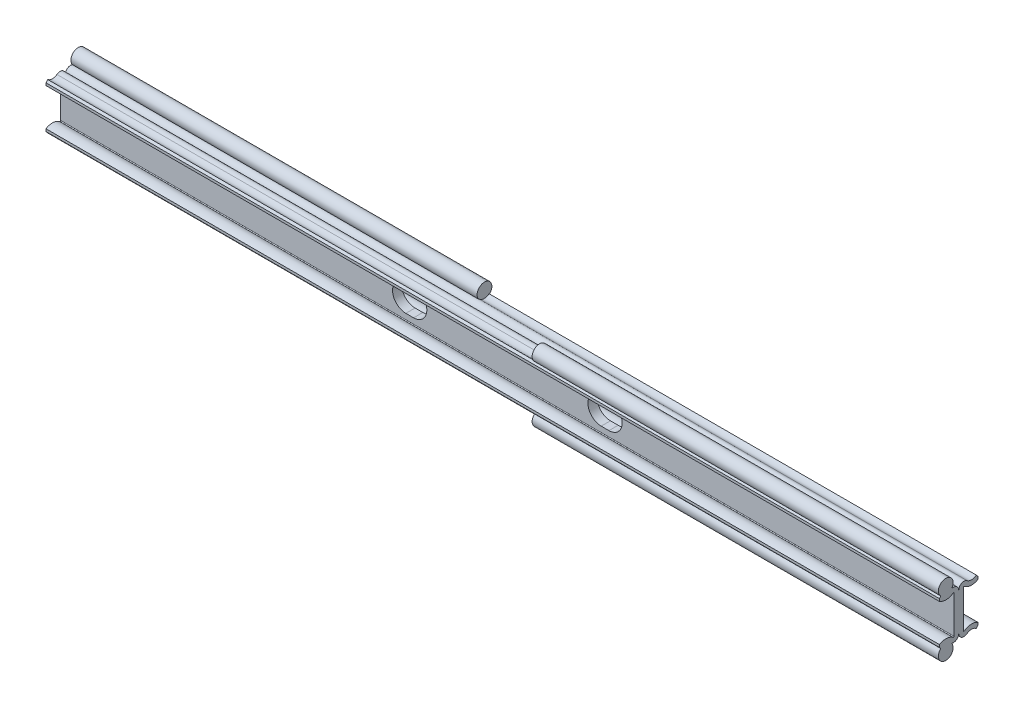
ISO-10303-21;
HEADER;
FILE_DESCRIPTION(('STEP AP214'),'2;1');
FILE_NAME('part.step','',(''),(''),'','','');
FILE_SCHEMA(('AUTOMOTIVE_DESIGN { 1 0 10303 214 1 1 1 1 }'));
ENDSEC;
DATA;
#1=APPLICATION_CONTEXT('core data for automotive mechanical design processes');
#2=APPLICATION_PROTOCOL_DEFINITION('international standard','automotive_design',2000,#1);
#3=PRODUCT_CONTEXT('',#1,'mechanical');
#4=PRODUCT('Part','Part','',(#3));
#5=PRODUCT_RELATED_PRODUCT_CATEGORY('part','',(#4));
#6=PRODUCT_DEFINITION_FORMATION('','',#4);
#7=PRODUCT_DEFINITION_CONTEXT('part definition',#1,'design');
#8=PRODUCT_DEFINITION('design','',#6,#7);
#9=PRODUCT_DEFINITION_SHAPE('','',#8);
#10=(LENGTH_UNIT() NAMED_UNIT(*) SI_UNIT(.MILLI.,.METRE.));
#11=(NAMED_UNIT(*) PLANE_ANGLE_UNIT() SI_UNIT($,.RADIAN.));
#12=(NAMED_UNIT(*) SI_UNIT($,.STERADIAN.) SOLID_ANGLE_UNIT());
#13=UNCERTAINTY_MEASURE_WITH_UNIT(LENGTH_MEASURE(1.E-05),#10,'distance_accuracy_value','');
#14=(GEOMETRIC_REPRESENTATION_CONTEXT(3) GLOBAL_UNCERTAINTY_ASSIGNED_CONTEXT((#13)) GLOBAL_UNIT_ASSIGNED_CONTEXT((#10,
#11,#12)) REPRESENTATION_CONTEXT('',''));
#15=CARTESIAN_POINT('',(0.,0.,0.));
#16=DIRECTION('',(0.,0.,1.));
#17=DIRECTION('',(1.,0.,0.));
#18=AXIS2_PLACEMENT_3D('',#15,#16,#17);
#19=CARTESIAN_POINT('',(-150.,9.67000022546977,4.31000011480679));
#20=DIRECTION('',(1.,0.,0.));
#21=DIRECTION('',(0.,0.,-1.));
#22=AXIS2_PLACEMENT_3D('',#19,#20,#21);
#23=CYLINDRICAL_SURFACE('',#22,2.48000011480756);
#24=CARTESIAN_POINT('',(13.6,9.67000022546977,4.31000011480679));
#25=DIRECTION('',(1.,0.,0.));
#26=DIRECTION('',(0.,0.,-1.));
#27=AXIS2_PLACEMENT_3D('',#24,#25,#26);
#28=CIRCLE('',#27,2.48000011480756);
#29=CARTESIAN_POINT('',(13.6,7.69573962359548,2.80910183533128));
#30=VERTEX_POINT('',#29);
#31=CARTESIAN_POINT('',(13.6,7.77020990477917,5.90411344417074));
#32=VERTEX_POINT('',#31);
#33=EDGE_CURVE('E323',#30,#32,#28,.F.);
#34=ORIENTED_EDGE('',*,*,#33,.F.);
#35=DIRECTION('',(1.,0.,0.));
#36=VECTOR('',#35,1.);
#37=CARTESIAN_POINT('',(-150.,7.69573962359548,2.80910183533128));
#38=LINE('',#37,#36);
#39=CARTESIAN_POINT('',(-150.,7.69573962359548,2.80910183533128));
#40=VERTEX_POINT('',#39);
#41=EDGE_CURVE('E545',#40,#30,#38,.T.);
#42=ORIENTED_EDGE('',*,*,#41,.F.);
#43=CARTESIAN_POINT('',(-150.,9.67000022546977,4.31000011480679));
#44=DIRECTION('',(1.,0.,0.));
#45=DIRECTION('',(0.,0.,-1.));
#46=AXIS2_PLACEMENT_3D('',#43,#44,#45);
#47=CIRCLE('',#46,2.48000011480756);
#48=CARTESIAN_POINT('',(-150.,7.77020990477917,5.90411344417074));
#49=VERTEX_POINT('',#48);
#50=EDGE_CURVE('E506',#49,#40,#47,.T.);
#51=ORIENTED_EDGE('',*,*,#50,.F.);
#52=DIRECTION('',(1.,0.,0.));
#53=VECTOR('',#52,1.);
#54=CARTESIAN_POINT('',(-150.,7.77020990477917,5.90411344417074));
#55=LINE('',#54,#53);
#56=EDGE_CURVE('E548',#49,#32,#55,.T.);
#57=ORIENTED_EDGE('',*,*,#56,.T.);
#58=EDGE_LOOP('',(#34,#42,#51,#57));
#59=FACE_BOUND('',#58,.T.);
#60=ADVANCED_FACE('F14',(#59),#23,.F.);
#61=CARTESIAN_POINT('',(-150.,9.67000022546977,-4.31000011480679));
#62=DIRECTION('',(1.,0.,0.));
#63=DIRECTION('',(0.,0.,-1.));
#64=AXIS2_PLACEMENT_3D('',#61,#62,#63);
#65=CYLINDRICAL_SURFACE('',#64,2.48000011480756);
#66=CARTESIAN_POINT('',(-13.6,9.67000022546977,-4.31000011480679));
#67=DIRECTION('',(-1.,0.,0.));
#68=DIRECTION('',(0.,0.,1.));
#69=AXIS2_PLACEMENT_3D('',#66,#67,#68);
#70=CIRCLE('',#69,2.48000011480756);
#71=CARTESIAN_POINT('',(-13.6,7.69573962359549,-2.80910183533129));
#72=VERTEX_POINT('',#71);
#73=CARTESIAN_POINT('',(-13.6,7.77020990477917,-5.90411344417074));
#74=VERTEX_POINT('',#73);
#75=EDGE_CURVE('E357',#72,#74,#70,.F.);
#76=ORIENTED_EDGE('',*,*,#75,.F.);
#77=DIRECTION('',(1.,0.,0.));
#78=VECTOR('',#77,1.);
#79=CARTESIAN_POINT('',(-150.,7.69573962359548,-2.80910183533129));
#80=LINE('',#79,#78);
#81=CARTESIAN_POINT('',(150.,7.69573962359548,-2.80910183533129));
#82=VERTEX_POINT('',#81);
#83=EDGE_CURVE('E540',#72,#82,#80,.T.);
#84=ORIENTED_EDGE('',*,*,#83,.T.);
#85=CARTESIAN_POINT('',(150.,9.67000022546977,-4.31000011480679));
#86=DIRECTION('',(1.,0.,0.));
#87=DIRECTION('',(0.,0.,1.));
#88=AXIS2_PLACEMENT_3D('',#85,#86,#87);
#89=CIRCLE('',#88,2.48000011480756);
#90=CARTESIAN_POINT('',(150.,7.77020990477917,-5.90411344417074));
#91=VERTEX_POINT('',#90);
#92=EDGE_CURVE('E459',#82,#91,#89,.T.);
#93=ORIENTED_EDGE('',*,*,#92,.T.);
#94=DIRECTION('',(1.,0.,0.));
#95=VECTOR('',#94,1.);
#96=CARTESIAN_POINT('',(-150.,7.77020990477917,-5.90411344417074));
#97=LINE('',#96,#95);
#98=EDGE_CURVE('E538',#74,#91,#97,.T.);
#99=ORIENTED_EDGE('',*,*,#98,.F.);
#100=EDGE_LOOP('',(#76,#84,#93,#99));
#101=FACE_BOUND('',#100,.T.);
#102=ADVANCED_FACE('F682',(#101),#65,.F.);
#103=CARTESIAN_POINT('',(-150.,-6.30261222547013,-1.75000011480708));
#104=DIRECTION('',(1.,0.,0.));
#105=DIRECTION('',(0.,0.,-1.));
#106=AXIS2_PLACEMENT_3D('',#103,#104,#105);
#107=CYLINDRICAL_SURFACE('',#106,0.200000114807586);
#108=CARTESIAN_POINT('',(150.,-6.30261222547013,-1.75000011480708));
#109=DIRECTION('',(1.,0.,0.));
#110=DIRECTION('',(0.,0.,-1.));
#111=AXIS2_PLACEMENT_3D('',#108,#109,#110);
#112=CIRCLE('',#111,0.200000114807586);
#113=CARTESIAN_POINT('',(150.,-6.30261222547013,-1.54999999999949));
#114=VERTEX_POINT('',#113);
#115=CARTESIAN_POINT('',(150.,-6.46182696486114,-1.87104024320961));
#116=VERTEX_POINT('',#115);
#117=EDGE_CURVE('E423',#114,#116,#112,.T.);
#118=ORIENTED_EDGE('',*,*,#117,.T.);
#119=DIRECTION('',(1.,0.,0.));
#120=VECTOR('',#119,1.);
#121=CARTESIAN_POINT('',(-150.,-6.46182696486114,-1.87104024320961));
#122=LINE('',#121,#120);
#123=CARTESIAN_POINT('',(-150.,-6.46182696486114,-1.87104024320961));
#124=VERTEX_POINT('',#123);
#125=EDGE_CURVE('E591',#124,#116,#122,.T.);
#126=ORIENTED_EDGE('',*,*,#125,.F.);
#127=CARTESIAN_POINT('',(-150.,-6.30261222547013,-1.75000011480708));
#128=DIRECTION('',(1.,0.,0.));
#129=DIRECTION('',(0.,0.,-1.));
#130=AXIS2_PLACEMENT_3D('',#127,#128,#129);
#131=CIRCLE('',#130,0.200000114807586);
#132=CARTESIAN_POINT('',(-150.,-6.30261222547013,-1.54999999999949));
#133=VERTEX_POINT('',#132);
#134=EDGE_CURVE('E472',#133,#124,#131,.T.);
#135=ORIENTED_EDGE('',*,*,#134,.F.);
#136=DIRECTION('',(1.,0.,0.));
#137=VECTOR('',#136,1.);
#138=CARTESIAN_POINT('',(-150.,-6.30261222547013,-1.54999999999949));
#139=LINE('',#138,#137);
#140=EDGE_CURVE('E523',#133,#114,#139,.T.);
#141=ORIENTED_EDGE('',*,*,#140,.T.);
#142=EDGE_LOOP('',(#118,#126,#135,#141));
#143=FACE_BOUND('',#142,.T.);
#144=ADVANCED_FACE('F16',(#143),#107,.F.);
#145=CARTESIAN_POINT('',(-150.,-9.67000022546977,-4.31000011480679));
#146=DIRECTION('',(1.,0.,0.));
#147=DIRECTION('',(0.,0.,-1.));
#148=AXIS2_PLACEMENT_3D('',#145,#146,#147);
#149=CYLINDRICAL_SURFACE('',#148,4.03000011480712);
#150=CARTESIAN_POINT('',(150.,-9.67000022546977,-4.31000011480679));
#151=DIRECTION('',(-1.,0.,0.));
#152=DIRECTION('',(0.,0.,-1.));
#153=AXIS2_PLACEMENT_3D('',#150,#151,#152);
#154=CIRCLE('',#153,4.03000011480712);
#155=CARTESIAN_POINT('',(150.,-6.26775086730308,-6.47000016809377));
#156=VERTEX_POINT('',#155);
#157=EDGE_CURVE('E426',#116,#156,#154,.T.);
#158=ORIENTED_EDGE('',*,*,#157,.T.);
#159=DIRECTION('',(1.,0.,0.));
#160=VECTOR('',#159,1.);
#161=CARTESIAN_POINT('',(-150.,-6.26775086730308,-6.47000016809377));
#162=LINE('',#161,#160);
#163=CARTESIAN_POINT('',(-150.,-6.26775086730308,-6.47000016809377));
#164=VERTEX_POINT('',#163);
#165=EDGE_CURVE('E588',#164,#156,#162,.T.);
#166=ORIENTED_EDGE('',*,*,#165,.F.);
#167=CARTESIAN_POINT('',(-150.,-9.67000022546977,-4.31000011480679));
#168=DIRECTION('',(-1.,0.,0.));
#169=DIRECTION('',(0.,0.,-1.));
#170=AXIS2_PLACEMENT_3D('',#167,#168,#169);
#171=CIRCLE('',#170,4.03000011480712);
#172=EDGE_CURVE('E475',#124,#164,#171,.T.);
#173=ORIENTED_EDGE('',*,*,#172,.F.);
#174=ORIENTED_EDGE('',*,*,#125,.T.);
#175=EDGE_LOOP('',(#158,#166,#173,#174));
#176=FACE_BOUND('',#175,.T.);
#177=ADVANCED_FACE('F731',(#176),#149,.T.);
#178=CARTESIAN_POINT('',(-150.,-6.26775086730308,-6.47000016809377));
#179=DIRECTION('',(0.,0.,1.));
#180=DIRECTION('',(1.,0.,0.));
#181=AXIS2_PLACEMENT_3D('',#178,#179,#180);
#182=PLANE('',#181);
#183=DIRECTION('',(0.,-1.,0.));
#184=VECTOR('',#183,1.);
#185=CARTESIAN_POINT('',(150.,-6.26775086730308,-6.47000016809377));
#186=LINE('',#185,#184);
#187=CARTESIAN_POINT('',(150.,-7.09581212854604,-6.47000016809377));
#188=VERTEX_POINT('',#187);
#189=EDGE_CURVE('E428',#156,#188,#186,.T.);
#190=ORIENTED_EDGE('',*,*,#189,.T.);
#191=DIRECTION('',(1.,0.,0.));
#192=VECTOR('',#191,1.);
#193=CARTESIAN_POINT('',(-150.,-7.09581212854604,-6.47000016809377));
#194=LINE('',#193,#192);
#195=CARTESIAN_POINT('',(-150.,-7.09581212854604,-6.47000016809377));
#196=VERTEX_POINT('',#195);
#197=EDGE_CURVE('E585',#196,#188,#194,.T.);
#198=ORIENTED_EDGE('',*,*,#197,.F.);
#199=DIRECTION('',(0.,-1.,0.));
#200=VECTOR('',#199,1.);
#201=CARTESIAN_POINT('',(-150.,-6.26775086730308,-6.47000016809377));
#202=LINE('',#201,#200);
#203=EDGE_CURVE('E477',#164,#196,#202,.T.);
#204=ORIENTED_EDGE('',*,*,#203,.F.);
#205=ORIENTED_EDGE('',*,*,#165,.T.);
#206=EDGE_LOOP('',(#190,#198,#204,#205));
#207=FACE_BOUND('',#206,.T.);
#208=ADVANCED_FACE('F728',(#207),#182,.F.);
#209=CARTESIAN_POINT('',(-150.,-7.77020990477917,-5.90411344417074));
#210=DIRECTION('',(0.,0.642787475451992,0.766044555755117));
#211=DIRECTION('',(0.,0.766044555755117,-0.642787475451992));
#212=AXIS2_PLACEMENT_3D('',#209,#210,#211);
#213=PLANE('',#212);
#214=DIRECTION('',(0.,0.766044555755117,-0.642787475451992));
#215=VECTOR('',#214,1.);
#216=CARTESIAN_POINT('',(-13.6,-7.77020990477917,-5.90411344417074));
#217=LINE('',#216,#215);
#218=CARTESIAN_POINT('',(-13.6,-7.77020990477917,-5.90411344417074));
#219=VERTEX_POINT('',#218);
#220=CARTESIAN_POINT('',(-13.6,-7.62948341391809,-6.02219694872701));
#221=VERTEX_POINT('',#220);
#222=EDGE_CURVE('E343',#219,#221,#217,.T.);
#223=ORIENTED_EDGE('',*,*,#222,.T.);
#224=DIRECTION('',(-1.,0.,0.));
#225=VECTOR('',#224,1.);
#226=CARTESIAN_POINT('',(-13.6,-7.62948341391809,-6.02219694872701));
#227=LINE('',#226,#225);
#228=CARTESIAN_POINT('',(-150.,-7.62948341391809,-6.02219694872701));
#229=VERTEX_POINT('',#228);
#230=EDGE_CURVE('E337',#221,#229,#227,.T.);
#231=ORIENTED_EDGE('',*,*,#230,.T.);
#232=DIRECTION('',(0.,-0.766044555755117,0.642787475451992));
#233=VECTOR('',#232,1.);
#234=CARTESIAN_POINT('',(-150.,-7.77020990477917,-5.90411344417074));
#235=LINE('',#234,#233);
#236=EDGE_CURVE('E479',#196,#229,#235,.T.);
#237=ORIENTED_EDGE('',*,*,#236,.F.);
#238=ORIENTED_EDGE('',*,*,#197,.T.);
#239=DIRECTION('',(0.,-0.766044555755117,0.642787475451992));
#240=VECTOR('',#239,1.);
#241=CARTESIAN_POINT('',(150.,-7.77020990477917,-5.90411344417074));
#242=LINE('',#241,#240);
#243=CARTESIAN_POINT('',(150.,-7.77020990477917,-5.90411344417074));
#244=VERTEX_POINT('',#243);
#245=EDGE_CURVE('E430',#188,#244,#242,.T.);
#246=ORIENTED_EDGE('',*,*,#245,.T.);
#247=DIRECTION('',(1.,0.,0.));
#248=VECTOR('',#247,1.);
#249=CARTESIAN_POINT('',(-150.,-7.77020990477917,-5.90411344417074));
#250=LINE('',#249,#248);
#251=EDGE_CURVE('E583',#219,#244,#250,.T.);
#252=ORIENTED_EDGE('',*,*,#251,.F.);
#253=EDGE_LOOP('',(#223,#231,#237,#238,#246,#252));
#254=FACE_BOUND('',#253,.T.);
#255=ADVANCED_FACE('F724',(#254),#213,.F.);
#256=CARTESIAN_POINT('',(-150.,-9.67000022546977,-4.31000011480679));
#257=DIRECTION('',(1.,0.,0.));
#258=DIRECTION('',(0.,0.,-1.));
#259=AXIS2_PLACEMENT_3D('',#256,#257,#258);
#260=CYLINDRICAL_SURFACE('',#259,2.48000011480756);
#261=DIRECTION('',(1.,0.,0.));
#262=VECTOR('',#261,1.);
#263=CARTESIAN_POINT('',(-150.,-7.69573962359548,-2.80910183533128));
#264=LINE('',#263,#262);
#265=CARTESIAN_POINT('',(-13.6,-7.69573962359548,-2.80910183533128));
#266=VERTEX_POINT('',#265);
#267=CARTESIAN_POINT('',(150.,-7.69573962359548,-2.80910183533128));
#268=VERTEX_POINT('',#267);
#269=EDGE_CURVE('E581',#266,#268,#264,.T.);
#270=ORIENTED_EDGE('',*,*,#269,.F.);
#271=CARTESIAN_POINT('',(-13.6,-9.67000022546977,-4.31000011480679));
#272=DIRECTION('',(1.,0.,0.));
#273=DIRECTION('',(0.,0.,-1.));
#274=AXIS2_PLACEMENT_3D('',#271,#272,#273);
#275=CIRCLE('',#274,2.48000011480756);
#276=EDGE_CURVE('E340',#266,#219,#275,.F.);
#277=ORIENTED_EDGE('',*,*,#276,.T.);
#278=ORIENTED_EDGE('',*,*,#251,.T.);
#279=CARTESIAN_POINT('',(150.,-9.67000022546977,-4.31000011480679));
#280=DIRECTION('',(1.,0.,0.));
#281=DIRECTION('',(0.,0.,-1.));
#282=AXIS2_PLACEMENT_3D('',#279,#280,#281);
#283=CIRCLE('',#282,2.48000011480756);
#284=EDGE_CURVE('E433',#244,#268,#283,.T.);
#285=ORIENTED_EDGE('',*,*,#284,.T.);
#286=EDGE_LOOP('',(#270,#277,#278,#285));
#287=FACE_BOUND('',#286,.T.);
#288=ADVANCED_FACE('F720',(#287),#260,.F.);
#289=CARTESIAN_POINT('',(-150.,-6.30261222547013,-1.75000011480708));
#290=DIRECTION('',(1.,0.,0.));
#291=DIRECTION('',(0.,0.,-1.));
#292=AXIS2_PLACEMENT_3D('',#289,#290,#291);
#293=CYLINDRICAL_SURFACE('',#292,1.75000011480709);
#294=CARTESIAN_POINT('',(-150.,-6.30261222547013,-1.75000011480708));
#295=DIRECTION('',(-1.,0.,0.));
#296=DIRECTION('',(0.,0.,-1.));
#297=AXIS2_PLACEMENT_3D('',#294,#295,#296);
#298=CIRCLE('',#297,1.75000011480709);
#299=CARTESIAN_POINT('',(-150.,-7.91637379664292,-2.42695948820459));
#300=VERTEX_POINT('',#299);
#301=CARTESIAN_POINT('',(-150.,-6.30261222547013,0.));
#302=VERTEX_POINT('',#301);
#303=EDGE_CURVE('E482',#300,#302,#298,.T.);
#304=ORIENTED_EDGE('',*,*,#303,.F.);
#305=DIRECTION('',(-1.,0.,0.));
#306=VECTOR('',#305,1.);
#307=CARTESIAN_POINT('',(-81.8,-7.91637379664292,-2.42695948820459));
#308=LINE('',#307,#306);
#309=CARTESIAN_POINT('',(-13.6,-7.91637379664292,-2.42695948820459));
#310=VERTEX_POINT('',#309);
#311=EDGE_CURVE('E333',#300,#310,#308,.F.);
#312=ORIENTED_EDGE('',*,*,#311,.T.);
#313=CARTESIAN_POINT('',(-13.6,-6.30261222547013,-1.75000011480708));
#314=DIRECTION('',(1.,0.,0.));
#315=DIRECTION('',(0.,0.,-1.));
#316=AXIS2_PLACEMENT_3D('',#313,#314,#315);
#317=CIRCLE('',#316,1.75000011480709);
#318=EDGE_CURVE('E596',#310,#266,#317,.T.);
#319=ORIENTED_EDGE('',*,*,#318,.T.);
#320=ORIENTED_EDGE('',*,*,#269,.T.);
#321=CARTESIAN_POINT('',(150.,-6.30261222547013,-1.75000011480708));
#322=DIRECTION('',(-1.,0.,0.));
#323=DIRECTION('',(0.,0.,-1.));
#324=AXIS2_PLACEMENT_3D('',#321,#322,#323);
#325=CIRCLE('',#324,1.75000011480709);
#326=CARTESIAN_POINT('',(150.,-6.30261222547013,0.));
#327=VERTEX_POINT('',#326);
#328=EDGE_CURVE('E436',#268,#327,#325,.T.);
#329=ORIENTED_EDGE('',*,*,#328,.T.);
#330=DIRECTION('',(1.,0.,0.));
#331=VECTOR('',#330,1.);
#332=CARTESIAN_POINT('',(-150.,-6.30261222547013,0.));
#333=LINE('',#332,#331);
#334=EDGE_CURVE('E578',#302,#327,#333,.T.);
#335=ORIENTED_EDGE('',*,*,#334,.F.);
#336=EDGE_LOOP('',(#304,#312,#319,#320,#329,#335));
#337=FACE_BOUND('',#336,.T.);
#338=ADVANCED_FACE('F717',(#337),#293,.T.);
#339=CARTESIAN_POINT('',(-150.,-6.30261222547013,1.75000011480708));
#340=DIRECTION('',(1.,0.,0.));
#341=DIRECTION('',(0.,0.,-1.));
#342=AXIS2_PLACEMENT_3D('',#339,#340,#341);
#343=CYLINDRICAL_SURFACE('',#342,1.75000011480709);
#344=CARTESIAN_POINT('',(150.,-6.30261222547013,1.75000011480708));
#345=DIRECTION('',(-1.,0.,0.));
#346=DIRECTION('',(0.,0.,1.));
#347=AXIS2_PLACEMENT_3D('',#344,#345,#346);
#348=CIRCLE('',#347,1.75000011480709);
#349=CARTESIAN_POINT('',(150.,-7.91637379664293,2.42695948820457));
#350=VERTEX_POINT('',#349);
#351=EDGE_CURVE('E292',#327,#350,#348,.T.);
#352=ORIENTED_EDGE('',*,*,#351,.T.);
#353=DIRECTION('',(1.,0.,0.));
#354=VECTOR('',#353,1.);
#355=CARTESIAN_POINT('',(81.8,-7.91637379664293,2.42695948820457));
#356=LINE('',#355,#354);
#357=CARTESIAN_POINT('',(13.6,-7.91637379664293,2.42695948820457));
#358=VERTEX_POINT('',#357);
#359=EDGE_CURVE('E29',#350,#358,#356,.F.);
#360=ORIENTED_EDGE('',*,*,#359,.T.);
#361=CARTESIAN_POINT('',(13.6,-6.30261222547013,1.75000011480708));
#362=DIRECTION('',(-1.,0.,0.));
#363=DIRECTION('',(0.,0.,1.));
#364=AXIS2_PLACEMENT_3D('',#361,#362,#363);
#365=CIRCLE('',#364,1.75000011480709);
#366=CARTESIAN_POINT('',(13.6,-7.69573962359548,2.80910183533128));
#367=VERTEX_POINT('',#366);
#368=EDGE_CURVE('E33',#358,#367,#365,.T.);
#369=ORIENTED_EDGE('',*,*,#368,.T.);
#370=DIRECTION('',(1.,0.,0.));
#371=VECTOR('',#370,1.);
#372=CARTESIAN_POINT('',(-150.,-7.69573962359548,2.80910183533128));
#373=LINE('',#372,#371);
#374=CARTESIAN_POINT('',(-150.,-7.69573962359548,2.80910183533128));
#375=VERTEX_POINT('',#374);
#376=EDGE_CURVE('E576',#375,#367,#373,.T.);
#377=ORIENTED_EDGE('',*,*,#376,.F.);
#378=CARTESIAN_POINT('',(-150.,-6.30261222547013,1.75000011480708));
#379=DIRECTION('',(-1.,0.,0.));
#380=DIRECTION('',(0.,0.,1.));
#381=AXIS2_PLACEMENT_3D('',#378,#379,#380);
#382=CIRCLE('',#381,1.75000011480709);
#383=EDGE_CURVE('E484',#302,#375,#382,.T.);
#384=ORIENTED_EDGE('',*,*,#383,.F.);
#385=ORIENTED_EDGE('',*,*,#334,.T.);
#386=EDGE_LOOP('',(#352,#360,#369,#377,#384,#385));
#387=FACE_BOUND('',#386,.T.);
#388=ADVANCED_FACE('F714',(#387),#343,.T.);
#389=CARTESIAN_POINT('',(-150.,-9.67000022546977,4.31000011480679));
#390=DIRECTION('',(1.,0.,0.));
#391=DIRECTION('',(0.,0.,-1.));
#392=AXIS2_PLACEMENT_3D('',#389,#390,#391);
#393=CYLINDRICAL_SURFACE('',#392,2.48000011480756);
#394=ORIENTED_EDGE('',*,*,#376,.T.);
#395=CARTESIAN_POINT('',(13.6,-9.67000022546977,4.31000011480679));
#396=DIRECTION('',(-1.,0.,0.));
#397=DIRECTION('',(0.,0.,1.));
#398=AXIS2_PLACEMENT_3D('',#395,#396,#397);
#399=CIRCLE('',#398,2.48000011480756);
#400=CARTESIAN_POINT('',(13.6,-7.77020990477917,5.90411344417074));
#401=VERTEX_POINT('',#400);
#402=EDGE_CURVE('E309',#367,#401,#399,.F.);
#403=ORIENTED_EDGE('',*,*,#402,.T.);
#404=DIRECTION('',(1.,0.,0.));
#405=VECTOR('',#404,1.);
#406=CARTESIAN_POINT('',(-150.,-7.77020990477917,5.90411344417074));
#407=LINE('',#406,#405);
#408=CARTESIAN_POINT('',(-150.,-7.77020990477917,5.90411344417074));
#409=VERTEX_POINT('',#408);
#410=EDGE_CURVE('E574',#409,#401,#407,.T.);
#411=ORIENTED_EDGE('',*,*,#410,.F.);
#412=CARTESIAN_POINT('',(-150.,-9.67000022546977,4.31000011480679));
#413=DIRECTION('',(1.,0.,0.));
#414=DIRECTION('',(0.,0.,1.));
#415=AXIS2_PLACEMENT_3D('',#412,#413,#414);
#416=CIRCLE('',#415,2.48000011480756);
#417=EDGE_CURVE('E486',#375,#409,#416,.T.);
#418=ORIENTED_EDGE('',*,*,#417,.F.);
#419=EDGE_LOOP('',(#394,#403,#411,#418));
#420=FACE_BOUND('',#419,.T.);
#421=ADVANCED_FACE('F667',(#420),#393,.F.);
#422=CARTESIAN_POINT('',(-150.,-7.77020990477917,5.90411344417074));
#423=DIRECTION('',(0.,0.642787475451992,-0.766044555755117));
#424=DIRECTION('',(0.,-0.766044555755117,-0.642787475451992));
#425=AXIS2_PLACEMENT_3D('',#422,#423,#424);
#426=PLANE('',#425);
#427=DIRECTION('',(0.,0.766044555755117,0.642787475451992));
#428=VECTOR('',#427,1.);
#429=CARTESIAN_POINT('',(13.6,-7.77020990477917,5.90411344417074));
#430=LINE('',#429,#428);
#431=CARTESIAN_POINT('',(13.6,-7.62948341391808,6.02219694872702));
#432=VERTEX_POINT('',#431);
#433=EDGE_CURVE('E9',#401,#432,#430,.T.);
#434=ORIENTED_EDGE('',*,*,#433,.T.);
#435=DIRECTION('',(1.,0.,0.));
#436=VECTOR('',#435,1.);
#437=CARTESIAN_POINT('',(13.6,-7.62948341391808,6.02219694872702));
#438=LINE('',#437,#436);
#439=CARTESIAN_POINT('',(150.,-7.62948341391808,6.02219694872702));
#440=VERTEX_POINT('',#439);
#441=EDGE_CURVE('E295',#432,#440,#438,.T.);
#442=ORIENTED_EDGE('',*,*,#441,.T.);
#443=DIRECTION('',(0.,0.766044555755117,0.642787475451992));
#444=VECTOR('',#443,1.);
#445=CARTESIAN_POINT('',(150.,-7.77020990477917,5.90411344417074));
#446=LINE('',#445,#444);
#447=CARTESIAN_POINT('',(150.,-7.09581212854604,6.47000016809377));
#448=VERTEX_POINT('',#447);
#449=EDGE_CURVE('E281',#440,#448,#446,.T.);
#450=ORIENTED_EDGE('',*,*,#449,.T.);
#451=DIRECTION('',(1.,0.,0.));
#452=VECTOR('',#451,1.);
#453=CARTESIAN_POINT('',(-150.,-7.09581212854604,6.47000016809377));
#454=LINE('',#453,#452);
#455=CARTESIAN_POINT('',(-150.,-7.09581212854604,6.47000016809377));
#456=VERTEX_POINT('',#455);
#457=EDGE_CURVE('E572',#456,#448,#454,.T.);
#458=ORIENTED_EDGE('',*,*,#457,.F.);
#459=DIRECTION('',(0.,0.766044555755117,0.642787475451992));
#460=VECTOR('',#459,1.);
#461=CARTESIAN_POINT('',(-150.,-7.77020990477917,5.90411344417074));
#462=LINE('',#461,#460);
#463=EDGE_CURVE('E488',#409,#456,#462,.T.);
#464=ORIENTED_EDGE('',*,*,#463,.F.);
#465=ORIENTED_EDGE('',*,*,#410,.T.);
#466=EDGE_LOOP('',(#434,#442,#450,#458,#464,#465));
#467=FACE_BOUND('',#466,.T.);
#468=ADVANCED_FACE('F296',(#467),#426,.F.);
#469=CARTESIAN_POINT('',(-150.,-6.26775086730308,6.47000016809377));
#470=DIRECTION('',(0.,0.,-1.));
#471=DIRECTION('',(-1.,0.,0.));
#472=AXIS2_PLACEMENT_3D('',#469,#470,#471);
#473=PLANE('',#472);
#474=DIRECTION('',(0.,1.,0.));
#475=VECTOR('',#474,1.);
#476=CARTESIAN_POINT('',(150.,-6.26775086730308,6.47000016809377));
#477=LINE('',#476,#475);
#478=CARTESIAN_POINT('',(150.,-6.26775086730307,6.47000016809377));
#479=VERTEX_POINT('',#478);
#480=EDGE_CURVE('E288',#448,#479,#477,.T.);
#481=ORIENTED_EDGE('',*,*,#480,.T.);
#482=DIRECTION('',(1.,0.,0.));
#483=VECTOR('',#482,1.);
#484=CARTESIAN_POINT('',(-150.,-6.26775086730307,6.47000016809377));
#485=LINE('',#484,#483);
#486=CARTESIAN_POINT('',(-150.,-6.26775086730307,6.47000016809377));
#487=VERTEX_POINT('',#486);
#488=EDGE_CURVE('E569',#487,#479,#485,.T.);
#489=ORIENTED_EDGE('',*,*,#488,.F.);
#490=DIRECTION('',(0.,1.,0.));
#491=VECTOR('',#490,1.);
#492=CARTESIAN_POINT('',(-150.,-6.26775086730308,6.47000016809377));
#493=LINE('',#492,#491);
#494=EDGE_CURVE('E490',#456,#487,#493,.T.);
#495=ORIENTED_EDGE('',*,*,#494,.F.);
#496=ORIENTED_EDGE('',*,*,#457,.T.);
#497=EDGE_LOOP('',(#481,#489,#495,#496));
#498=FACE_BOUND('',#497,.T.);
#499=ADVANCED_FACE('F661',(#498),#473,.F.);
#500=CARTESIAN_POINT('',(-150.,-9.67000022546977,4.31000011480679));
#501=DIRECTION('',(1.,0.,0.));
#502=DIRECTION('',(0.,0.,-1.));
#503=AXIS2_PLACEMENT_3D('',#500,#501,#502);
#504=CYLINDRICAL_SURFACE('',#503,4.03000011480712);
#505=CARTESIAN_POINT('',(150.,-9.67000022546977,4.31000011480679));
#506=DIRECTION('',(-1.,0.,0.));
#507=DIRECTION('',(0.,0.,1.));
#508=AXIS2_PLACEMENT_3D('',#505,#506,#507);
#509=CIRCLE('',#508,4.03000011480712);
#510=CARTESIAN_POINT('',(150.,-6.46182696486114,1.87104024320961));
#511=VERTEX_POINT('',#510);
#512=EDGE_CURVE('E440',#479,#511,#509,.T.);
#513=ORIENTED_EDGE('',*,*,#512,.T.);
#514=DIRECTION('',(1.,0.,0.));
#515=VECTOR('',#514,1.);
#516=CARTESIAN_POINT('',(-150.,-6.46182696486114,1.87104024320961));
#517=LINE('',#516,#515);
#518=CARTESIAN_POINT('',(-150.,-6.46182696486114,1.87104024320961));
#519=VERTEX_POINT('',#518);
#520=EDGE_CURVE('E566',#519,#511,#517,.T.);
#521=ORIENTED_EDGE('',*,*,#520,.F.);
#522=CARTESIAN_POINT('',(-150.,-9.67000022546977,4.31000011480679));
#523=DIRECTION('',(-1.,0.,0.));
#524=DIRECTION('',(0.,0.,1.));
#525=AXIS2_PLACEMENT_3D('',#522,#523,#524);
#526=CIRCLE('',#525,4.03000011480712);
#527=EDGE_CURVE('E492',#487,#519,#526,.T.);
#528=ORIENTED_EDGE('',*,*,#527,.F.);
#529=ORIENTED_EDGE('',*,*,#488,.T.);
#530=EDGE_LOOP('',(#513,#521,#528,#529));
#531=FACE_BOUND('',#530,.T.);
#532=ADVANCED_FACE('F657',(#531),#504,.T.);
#533=CARTESIAN_POINT('',(-150.,-6.30261222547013,1.75000011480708));
#534=DIRECTION('',(1.,0.,0.));
#535=DIRECTION('',(0.,0.,-1.));
#536=AXIS2_PLACEMENT_3D('',#533,#534,#535);
#537=CYLINDRICAL_SURFACE('',#536,0.200000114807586);
#538=CARTESIAN_POINT('',(150.,-6.30261222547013,1.75000011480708));
#539=DIRECTION('',(1.,0.,0.));
#540=DIRECTION('',(0.,0.,1.));
#541=AXIS2_PLACEMENT_3D('',#538,#539,#540);
#542=CIRCLE('',#541,0.200000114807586);
#543=CARTESIAN_POINT('',(150.,-6.30261222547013,1.54999999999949));
#544=VERTEX_POINT('',#543);
#545=EDGE_CURVE('E442',#511,#544,#542,.T.);
#546=ORIENTED_EDGE('',*,*,#545,.T.);
#547=DIRECTION('',(1.,0.,0.));
#548=VECTOR('',#547,1.);
#549=CARTESIAN_POINT('',(-150.,-6.30261222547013,1.54999999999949));
#550=LINE('',#549,#548);
#551=CARTESIAN_POINT('',(-150.,-6.30261222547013,1.54999999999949));
#552=VERTEX_POINT('',#551);
#553=EDGE_CURVE('E563',#552,#544,#550,.T.);
#554=ORIENTED_EDGE('',*,*,#553,.F.);
#555=CARTESIAN_POINT('',(-150.,-6.30261222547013,1.75000011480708));
#556=DIRECTION('',(1.,0.,0.));
#557=DIRECTION('',(0.,0.,1.));
#558=AXIS2_PLACEMENT_3D('',#555,#556,#557);
#559=CIRCLE('',#558,0.200000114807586);
#560=EDGE_CURVE('E494',#519,#552,#559,.T.);
#561=ORIENTED_EDGE('',*,*,#560,.F.);
#562=ORIENTED_EDGE('',*,*,#520,.T.);
#563=EDGE_LOOP('',(#546,#554,#561,#562));
#564=FACE_BOUND('',#563,.T.);
#565=ADVANCED_FACE('F652',(#564),#537,.F.);
#566=CARTESIAN_POINT('',(-150.,-6.30261222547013,1.54999999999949));
#567=DIRECTION('',(0.,0.,-1.));
#568=DIRECTION('',(-1.,0.,0.));
#569=AXIS2_PLACEMENT_3D('',#566,#567,#568);
#570=PLANE('',#569);
#571=DIRECTION('',(1.,0.,0.));
#572=VECTOR('',#571,1.);
#573=CARTESIAN_POINT('',(-34.1,-4.45,1.54999999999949));
#574=LINE('',#573,#572);
#575=CARTESIAN_POINT('',(-34.1,-4.45,1.54999999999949));
#576=VERTEX_POINT('',#575);
#577=CARTESIAN_POINT('',(-31.5,-4.45,1.54999999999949));
#578=VERTEX_POINT('',#577);
#579=EDGE_CURVE('E371',#576,#578,#574,.T.);
#580=ORIENTED_EDGE('',*,*,#579,.F.);
#581=CARTESIAN_POINT('',(-34.1,0.,1.54999999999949));
#582=DIRECTION('',(0.,0.,1.));
#583=DIRECTION('',(-1.,0.,0.));
#584=AXIS2_PLACEMENT_3D('',#581,#582,#583);
#585=CIRCLE('',#584,4.45);
#586=CARTESIAN_POINT('',(-34.1,4.45,1.54999999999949));
#587=VERTEX_POINT('',#586);
#588=EDGE_CURVE('E369',#587,#576,#585,.T.);
#589=ORIENTED_EDGE('',*,*,#588,.F.);
#590=DIRECTION('',(-1.,0.,0.));
#591=VECTOR('',#590,1.);
#592=CARTESIAN_POINT('',(-31.5,4.45,1.54999999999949));
#593=LINE('',#592,#591);
#594=CARTESIAN_POINT('',(-31.5,4.45,1.54999999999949));
#595=VERTEX_POINT('',#594);
#596=EDGE_CURVE('E377',#595,#587,#593,.T.);
#597=ORIENTED_EDGE('',*,*,#596,.F.);
#598=CARTESIAN_POINT('',(-31.5,0.,1.54999999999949));
#599=DIRECTION('',(0.,0.,1.));
#600=DIRECTION('',(-1.,0.,0.));
#601=AXIS2_PLACEMENT_3D('',#598,#599,#600);
#602=CIRCLE('',#601,4.45);
#603=EDGE_CURVE('E374',#578,#595,#602,.T.);
#604=ORIENTED_EDGE('',*,*,#603,.F.);
#605=EDGE_LOOP('',(#580,#589,#597,#604));
#606=FACE_BOUND('',#605,.T.);
#607=DIRECTION('',(1.,0.,0.));
#608=VECTOR('',#607,1.);
#609=CARTESIAN_POINT('',(34.1,-4.45,1.54999999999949));
#610=LINE('',#609,#608);
#611=CARTESIAN_POINT('',(31.5,-4.45,1.54999999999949));
#612=VERTEX_POINT('',#611);
#613=CARTESIAN_POINT('',(34.1,-4.45,1.54999999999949));
#614=VERTEX_POINT('',#613);
#615=EDGE_CURVE('E402',#612,#614,#610,.T.);
#616=ORIENTED_EDGE('',*,*,#615,.F.);
#617=CARTESIAN_POINT('',(31.5,0.,1.54999999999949));
#618=DIRECTION('',(0.,0.,1.));
#619=DIRECTION('',(1.,0.,0.));
#620=AXIS2_PLACEMENT_3D('',#617,#618,#619);
#621=CIRCLE('',#620,4.45);
#622=CARTESIAN_POINT('',(31.5,4.45,1.54999999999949));
#623=VERTEX_POINT('',#622);
#624=EDGE_CURVE('E400',#623,#612,#621,.T.);
#625=ORIENTED_EDGE('',*,*,#624,.F.);
#626=DIRECTION('',(-1.,0.,0.));
#627=VECTOR('',#626,1.);
#628=CARTESIAN_POINT('',(31.5,4.45,1.54999999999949));
#629=LINE('',#628,#627);
#630=CARTESIAN_POINT('',(34.1,4.45,1.54999999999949));
#631=VERTEX_POINT('',#630);
#632=EDGE_CURVE('E408',#631,#623,#629,.T.);
#633=ORIENTED_EDGE('',*,*,#632,.F.);
#634=CARTESIAN_POINT('',(34.1,0.,1.54999999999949));
#635=DIRECTION('',(0.,0.,1.));
#636=DIRECTION('',(1.,0.,0.));
#637=AXIS2_PLACEMENT_3D('',#634,#635,#636);
#638=CIRCLE('',#637,4.45);
#639=EDGE_CURVE('E405',#614,#631,#638,.T.);
#640=ORIENTED_EDGE('',*,*,#639,.F.);
#641=EDGE_LOOP('',(#616,#625,#633,#640));
#642=FACE_BOUND('',#641,.T.);
#643=DIRECTION('',(0.,1.,0.));
#644=VECTOR('',#643,1.);
#645=CARTESIAN_POINT('',(150.,-6.30261222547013,1.54999999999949));
#646=LINE('',#645,#644);
#647=CARTESIAN_POINT('',(150.,6.30261222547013,1.54999999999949));
#648=VERTEX_POINT('',#647);
#649=EDGE_CURVE('E444',#544,#648,#646,.T.);
#650=ORIENTED_EDGE('',*,*,#649,.T.);
#651=DIRECTION('',(1.,0.,0.));
#652=VECTOR('',#651,1.);
#653=CARTESIAN_POINT('',(-150.,6.30261222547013,1.54999999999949));
#654=LINE('',#653,#652);
#655=CARTESIAN_POINT('',(-150.,6.30261222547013,1.54999999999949));
#656=VERTEX_POINT('',#655);
#657=EDGE_CURVE('E560',#656,#648,#654,.T.);
#658=ORIENTED_EDGE('',*,*,#657,.F.);
#659=DIRECTION('',(0.,1.,0.));
#660=VECTOR('',#659,1.);
#661=CARTESIAN_POINT('',(-150.,-6.30261222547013,1.54999999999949));
#662=LINE('',#661,#660);
#663=EDGE_CURVE('E496',#552,#656,#662,.T.);
#664=ORIENTED_EDGE('',*,*,#663,.F.);
#665=ORIENTED_EDGE('',*,*,#553,.T.);
#666=EDGE_LOOP('',(#650,#658,#664,#665));
#667=FACE_BOUND('',#666,.T.);
#668=ADVANCED_FACE('F648',(#606,#642,#667),#570,.F.);
#669=CARTESIAN_POINT('',(-150.,6.30261222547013,1.75000011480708));
#670=DIRECTION('',(1.,0.,0.));
#671=DIRECTION('',(0.,0.,-1.));
#672=AXIS2_PLACEMENT_3D('',#669,#670,#671);
#673=CYLINDRICAL_SURFACE('',#672,0.200000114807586);
#674=CARTESIAN_POINT('',(150.,6.30261222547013,1.75000011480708));
#675=DIRECTION('',(1.,0.,0.));
#676=DIRECTION('',(0.,0.,-1.));
#677=AXIS2_PLACEMENT_3D('',#674,#675,#676);
#678=CIRCLE('',#677,0.200000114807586);
#679=CARTESIAN_POINT('',(150.,6.46182696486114,1.87104024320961));
#680=VERTEX_POINT('',#679);
#681=EDGE_CURVE('E446',#648,#680,#678,.T.);
#682=ORIENTED_EDGE('',*,*,#681,.T.);
#683=DIRECTION('',(1.,0.,0.));
#684=VECTOR('',#683,1.);
#685=CARTESIAN_POINT('',(-150.,6.46182696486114,1.87104024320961));
#686=LINE('',#685,#684);
#687=CARTESIAN_POINT('',(-150.,6.46182696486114,1.87104024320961));
#688=VERTEX_POINT('',#687);
#689=EDGE_CURVE('E557',#688,#680,#686,.T.);
#690=ORIENTED_EDGE('',*,*,#689,.F.);
#691=CARTESIAN_POINT('',(-150.,6.30261222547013,1.75000011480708));
#692=DIRECTION('',(1.,0.,0.));
#693=DIRECTION('',(0.,0.,-1.));
#694=AXIS2_PLACEMENT_3D('',#691,#692,#693);
#695=CIRCLE('',#694,0.200000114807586);
#696=EDGE_CURVE('E498',#656,#688,#695,.T.);
#697=ORIENTED_EDGE('',*,*,#696,.F.);
#698=ORIENTED_EDGE('',*,*,#657,.T.);
#699=EDGE_LOOP('',(#682,#690,#697,#698));
#700=FACE_BOUND('',#699,.T.);
#701=ADVANCED_FACE('F644',(#700),#673,.F.);
#702=CARTESIAN_POINT('',(-150.,9.67000022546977,4.31000011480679));
#703=DIRECTION('',(1.,0.,0.));
#704=DIRECTION('',(0.,0.,-1.));
#705=AXIS2_PLACEMENT_3D('',#702,#703,#704);
#706=CYLINDRICAL_SURFACE('',#705,4.03000011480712);
#707=CARTESIAN_POINT('',(150.,9.67000022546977,4.31000011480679));
#708=DIRECTION('',(-1.,0.,0.));
#709=DIRECTION('',(0.,0.,-1.));
#710=AXIS2_PLACEMENT_3D('',#707,#708,#709);
#711=CIRCLE('',#710,4.03000011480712);
#712=CARTESIAN_POINT('',(150.,6.26775086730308,6.47000016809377));
#713=VERTEX_POINT('',#712);
#714=EDGE_CURVE('E448',#680,#713,#711,.T.);
#715=ORIENTED_EDGE('',*,*,#714,.T.);
#716=DIRECTION('',(1.,0.,0.));
#717=VECTOR('',#716,1.);
#718=CARTESIAN_POINT('',(-150.,6.26775086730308,6.47000016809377));
#719=LINE('',#718,#717);
#720=CARTESIAN_POINT('',(-150.,6.26775086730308,6.47000016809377));
#721=VERTEX_POINT('',#720);
#722=EDGE_CURVE('E554',#721,#713,#719,.T.);
#723=ORIENTED_EDGE('',*,*,#722,.F.);
#724=CARTESIAN_POINT('',(-150.,9.67000022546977,4.31000011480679));
#725=DIRECTION('',(-1.,0.,0.));
#726=DIRECTION('',(0.,0.,-1.));
#727=AXIS2_PLACEMENT_3D('',#724,#725,#726);
#728=CIRCLE('',#727,4.03000011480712);
#729=EDGE_CURVE('E500',#688,#721,#728,.T.);
#730=ORIENTED_EDGE('',*,*,#729,.F.);
#731=ORIENTED_EDGE('',*,*,#689,.T.);
#732=EDGE_LOOP('',(#715,#723,#730,#731));
#733=FACE_BOUND('',#732,.T.);
#734=ADVANCED_FACE('F639',(#733),#706,.T.);
#735=CARTESIAN_POINT('',(-150.,6.26775086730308,6.47000016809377));
#736=DIRECTION('',(0.,0.,-1.));
#737=DIRECTION('',(-1.,0.,0.));
#738=AXIS2_PLACEMENT_3D('',#735,#736,#737);
#739=PLANE('',#738);
#740=DIRECTION('',(0.,1.,0.));
#741=VECTOR('',#740,1.);
#742=CARTESIAN_POINT('',(150.,6.26775086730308,6.47000016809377));
#743=LINE('',#742,#741);
#744=CARTESIAN_POINT('',(150.,7.09581212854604,6.47000016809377));
#745=VERTEX_POINT('',#744);
#746=EDGE_CURVE('E450',#713,#745,#743,.T.);
#747=ORIENTED_EDGE('',*,*,#746,.T.);
#748=DIRECTION('',(1.,0.,0.));
#749=VECTOR('',#748,1.);
#750=CARTESIAN_POINT('',(-150.,7.09581212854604,6.47000016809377));
#751=LINE('',#750,#749);
#752=CARTESIAN_POINT('',(-150.,7.09581212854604,6.47000016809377));
#753=VERTEX_POINT('',#752);
#754=EDGE_CURVE('E551',#753,#745,#751,.T.);
#755=ORIENTED_EDGE('',*,*,#754,.F.);
#756=DIRECTION('',(0.,1.,0.));
#757=VECTOR('',#756,1.);
#758=CARTESIAN_POINT('',(-150.,6.26775086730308,6.47000016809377));
#759=LINE('',#758,#757);
#760=EDGE_CURVE('E502',#721,#753,#759,.T.);
#761=ORIENTED_EDGE('',*,*,#760,.F.);
#762=ORIENTED_EDGE('',*,*,#722,.T.);
#763=EDGE_LOOP('',(#747,#755,#761,#762));
#764=FACE_BOUND('',#763,.T.);
#765=ADVANCED_FACE('F633',(#764),#739,.F.);
#766=CARTESIAN_POINT('',(-150.,7.77020990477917,5.90411344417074));
#767=DIRECTION('',(0.,-0.642787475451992,-0.766044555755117));
#768=DIRECTION('',(0.,-0.766044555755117,0.642787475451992));
#769=AXIS2_PLACEMENT_3D('',#766,#767,#768);
#770=PLANE('',#769);
#771=DIRECTION('',(0.,0.766044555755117,-0.642787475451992));
#772=VECTOR('',#771,1.);
#773=CARTESIAN_POINT('',(150.,7.77020990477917,5.90411344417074));
#774=LINE('',#773,#772);
#775=CARTESIAN_POINT('',(150.,7.62948341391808,6.02219694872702));
#776=VERTEX_POINT('',#775);
#777=EDGE_CURVE('E452',#745,#776,#774,.T.);
#778=ORIENTED_EDGE('',*,*,#777,.T.);
#779=DIRECTION('',(1.,0.,0.));
#780=VECTOR('',#779,1.);
#781=CARTESIAN_POINT('',(13.6,7.62948341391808,6.02219694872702));
#782=LINE('',#781,#780);
#783=CARTESIAN_POINT('',(13.6,7.62948341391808,6.02219694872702));
#784=VERTEX_POINT('',#783);
#785=EDGE_CURVE('E321',#776,#784,#782,.F.);
#786=ORIENTED_EDGE('',*,*,#785,.T.);
#787=DIRECTION('',(0.,-0.766044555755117,0.642787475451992));
#788=VECTOR('',#787,1.);
#789=CARTESIAN_POINT('',(13.6,7.77020990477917,5.90411344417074));
#790=LINE('',#789,#788);
#791=EDGE_CURVE('E326',#32,#784,#790,.T.);
#792=ORIENTED_EDGE('',*,*,#791,.F.);
#793=ORIENTED_EDGE('',*,*,#56,.F.);
#794=DIRECTION('',(0.,0.766044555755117,-0.642787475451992));
#795=VECTOR('',#794,1.);
#796=CARTESIAN_POINT('',(-150.,7.77020990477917,5.90411344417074));
#797=LINE('',#796,#795);
#798=EDGE_CURVE('E504',#753,#49,#797,.T.);
#799=ORIENTED_EDGE('',*,*,#798,.F.);
#800=ORIENTED_EDGE('',*,*,#754,.T.);
#801=EDGE_LOOP('',(#778,#786,#792,#793,#799,#800));
#802=FACE_BOUND('',#801,.T.);
#803=ADVANCED_FACE('F629',(#802),#770,.F.);
#804=CARTESIAN_POINT('',(-150.,6.30261222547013,1.75000011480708));
#805=DIRECTION('',(1.,0.,0.));
#806=DIRECTION('',(0.,0.,-1.));
#807=AXIS2_PLACEMENT_3D('',#804,#805,#806);
#808=CYLINDRICAL_SURFACE('',#807,1.75000011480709);
#809=CARTESIAN_POINT('',(13.6,6.30261222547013,1.75000011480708));
#810=DIRECTION('',(1.,0.,0.));
#811=DIRECTION('',(0.,0.,-1.));
#812=AXIS2_PLACEMENT_3D('',#809,#810,#811);
#813=CIRCLE('',#812,1.75000011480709);
#814=CARTESIAN_POINT('',(13.6,7.91637379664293,2.42695948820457));
#815=VERTEX_POINT('',#814);
#816=EDGE_CURVE('E22',#815,#30,#813,.T.);
#817=ORIENTED_EDGE('',*,*,#816,.F.);
#818=DIRECTION('',(1.,0.,0.));
#819=VECTOR('',#818,1.);
#820=CARTESIAN_POINT('',(81.8,7.91637379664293,2.42695948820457));
#821=LINE('',#820,#819);
#822=CARTESIAN_POINT('',(150.,7.91637379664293,2.42695948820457));
#823=VERTEX_POINT('',#822);
#824=EDGE_CURVE('E316',#815,#823,#821,.T.);
#825=ORIENTED_EDGE('',*,*,#824,.T.);
#826=CARTESIAN_POINT('',(150.,6.30261222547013,1.75000011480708));
#827=DIRECTION('',(-1.,0.,0.));
#828=DIRECTION('',(0.,0.,-1.));
#829=AXIS2_PLACEMENT_3D('',#826,#827,#828);
#830=CIRCLE('',#829,1.75000011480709);
#831=CARTESIAN_POINT('',(150.,6.30261222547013,0.));
#832=VERTEX_POINT('',#831);
#833=EDGE_CURVE('E454',#823,#832,#830,.T.);
#834=ORIENTED_EDGE('',*,*,#833,.T.);
#835=DIRECTION('',(1.,0.,0.));
#836=VECTOR('',#835,1.);
#837=CARTESIAN_POINT('',(-150.,6.30261222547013,0.));
#838=LINE('',#837,#836);
#839=CARTESIAN_POINT('',(-150.,6.30261222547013,0.));
#840=VERTEX_POINT('',#839);
#841=EDGE_CURVE('E542',#840,#832,#838,.T.);
#842=ORIENTED_EDGE('',*,*,#841,.F.);
#843=CARTESIAN_POINT('',(-150.,6.30261222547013,1.75000011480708));
#844=DIRECTION('',(-1.,0.,0.));
#845=DIRECTION('',(0.,0.,-1.));
#846=AXIS2_PLACEMENT_3D('',#843,#844,#845);
#847=CIRCLE('',#846,1.75000011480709);
#848=EDGE_CURVE('E508',#40,#840,#847,.T.);
#849=ORIENTED_EDGE('',*,*,#848,.F.);
#850=ORIENTED_EDGE('',*,*,#41,.T.);
#851=EDGE_LOOP('',(#817,#825,#834,#842,#849,#850));
#852=FACE_BOUND('',#851,.T.);
#853=ADVANCED_FACE('F604',(#852),#808,.T.);
#854=CARTESIAN_POINT('',(-150.,6.30261222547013,-1.75000011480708));
#855=DIRECTION('',(1.,0.,0.));
#856=DIRECTION('',(0.,0.,-1.));
#857=AXIS2_PLACEMENT_3D('',#854,#855,#856);
#858=CYLINDRICAL_SURFACE('',#857,1.75000011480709);
#859=CARTESIAN_POINT('',(-13.6,6.30261222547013,-1.75000011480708));
#860=DIRECTION('',(-1.,0.,0.));
#861=DIRECTION('',(0.,0.,1.));
#862=AXIS2_PLACEMENT_3D('',#859,#860,#861);
#863=CIRCLE('',#862,1.75000011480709);
#864=CARTESIAN_POINT('',(-13.6,7.91637379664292,-2.42695948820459));
#865=VERTEX_POINT('',#864);
#866=EDGE_CURVE('E359',#865,#72,#863,.T.);
#867=ORIENTED_EDGE('',*,*,#866,.F.);
#868=DIRECTION('',(-1.,0.,0.));
#869=VECTOR('',#868,1.);
#870=CARTESIAN_POINT('',(-81.8,7.91637379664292,-2.42695948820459));
#871=LINE('',#870,#869);
#872=CARTESIAN_POINT('',(-150.,7.91637379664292,-2.42695948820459));
#873=VERTEX_POINT('',#872);
#874=EDGE_CURVE('E354',#865,#873,#871,.T.);
#875=ORIENTED_EDGE('',*,*,#874,.T.);
#876=CARTESIAN_POINT('',(-150.,6.30261222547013,-1.75000011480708));
#877=DIRECTION('',(-1.,0.,0.));
#878=DIRECTION('',(0.,0.,1.));
#879=AXIS2_PLACEMENT_3D('',#876,#877,#878);
#880=CIRCLE('',#879,1.75000011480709);
#881=EDGE_CURVE('E510',#840,#873,#880,.T.);
#882=ORIENTED_EDGE('',*,*,#881,.F.);
#883=ORIENTED_EDGE('',*,*,#841,.T.);
#884=CARTESIAN_POINT('',(150.,6.30261222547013,-1.75000011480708));
#885=DIRECTION('',(-1.,0.,0.));
#886=DIRECTION('',(0.,0.,1.));
#887=AXIS2_PLACEMENT_3D('',#884,#885,#886);
#888=CIRCLE('',#887,1.75000011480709);
#889=EDGE_CURVE('E456',#832,#82,#888,.T.);
#890=ORIENTED_EDGE('',*,*,#889,.T.);
#891=ORIENTED_EDGE('',*,*,#83,.F.);
#892=EDGE_LOOP('',(#867,#875,#882,#883,#890,#891));
#893=FACE_BOUND('',#892,.T.);
#894=ADVANCED_FACE('F619',(#893),#858,.T.);
#895=CARTESIAN_POINT('',(-150.,7.77020990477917,-5.90411344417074));
#896=DIRECTION('',(0.,-0.642787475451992,0.766044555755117));
#897=DIRECTION('',(0.,0.766044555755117,0.642787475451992));
#898=AXIS2_PLACEMENT_3D('',#895,#896,#897);
#899=PLANE('',#898);
#900=DIRECTION('',(0.,-0.766044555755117,-0.642787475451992));
#901=VECTOR('',#900,1.);
#902=CARTESIAN_POINT('',(-150.,7.77020990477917,-5.90411344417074));
#903=LINE('',#902,#901);
#904=CARTESIAN_POINT('',(-150.,7.62948341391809,-6.02219694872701));
#905=VERTEX_POINT('',#904);
#906=CARTESIAN_POINT('',(-150.,7.09581212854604,-6.47000016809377));
#907=VERTEX_POINT('',#906);
#908=EDGE_CURVE('E513',#905,#907,#903,.T.);
#909=ORIENTED_EDGE('',*,*,#908,.F.);
#910=DIRECTION('',(-1.,0.,0.));
#911=VECTOR('',#910,1.);
#912=CARTESIAN_POINT('',(-13.6,7.62948341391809,-6.02219694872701));
#913=LINE('',#912,#911);
#914=CARTESIAN_POINT('',(-13.6,7.62948341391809,-6.02219694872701));
#915=VERTEX_POINT('',#914);
#916=EDGE_CURVE('E350',#905,#915,#913,.F.);
#917=ORIENTED_EDGE('',*,*,#916,.T.);
#918=DIRECTION('',(0.,-0.766044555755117,-0.642787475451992));
#919=VECTOR('',#918,1.);
#920=CARTESIAN_POINT('',(-13.6,7.77020990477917,-5.90411344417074));
#921=LINE('',#920,#919);
#922=EDGE_CURVE('E594',#74,#915,#921,.T.);
#923=ORIENTED_EDGE('',*,*,#922,.F.);
#924=ORIENTED_EDGE('',*,*,#98,.T.);
#925=DIRECTION('',(0.,-0.766044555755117,-0.642787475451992));
#926=VECTOR('',#925,1.);
#927=CARTESIAN_POINT('',(150.,7.77020990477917,-5.90411344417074));
#928=LINE('',#927,#926);
#929=CARTESIAN_POINT('',(150.,7.09581212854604,-6.47000016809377));
#930=VERTEX_POINT('',#929);
#931=EDGE_CURVE('E462',#91,#930,#928,.T.);
#932=ORIENTED_EDGE('',*,*,#931,.T.);
#933=DIRECTION('',(1.,0.,0.));
#934=VECTOR('',#933,1.);
#935=CARTESIAN_POINT('',(-150.,7.09581212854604,-6.47000016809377));
#936=LINE('',#935,#934);
#937=EDGE_CURVE('E535',#907,#930,#936,.T.);
#938=ORIENTED_EDGE('',*,*,#937,.F.);
#939=EDGE_LOOP('',(#909,#917,#923,#924,#932,#938));
#940=FACE_BOUND('',#939,.T.);
#941=ADVANCED_FACE('F777',(#940),#899,.F.);
#942=CARTESIAN_POINT('',(-150.,6.26775086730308,-6.47000016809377));
#943=DIRECTION('',(0.,0.,1.));
#944=DIRECTION('',(1.,0.,0.));
#945=AXIS2_PLACEMENT_3D('',#942,#943,#944);
#946=PLANE('',#945);
#947=DIRECTION('',(0.,-1.,0.));
#948=VECTOR('',#947,1.);
#949=CARTESIAN_POINT('',(150.,6.26775086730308,-6.47000016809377));
#950=LINE('',#949,#948);
#951=CARTESIAN_POINT('',(150.,6.26775086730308,-6.47000016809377));
#952=VERTEX_POINT('',#951);
#953=EDGE_CURVE('E464',#930,#952,#950,.T.);
#954=ORIENTED_EDGE('',*,*,#953,.T.);
#955=DIRECTION('',(1.,0.,0.));
#956=VECTOR('',#955,1.);
#957=CARTESIAN_POINT('',(-150.,6.26775086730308,-6.47000016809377));
#958=LINE('',#957,#956);
#959=CARTESIAN_POINT('',(-150.,6.26775086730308,-6.47000016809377));
#960=VERTEX_POINT('',#959);
#961=EDGE_CURVE('E532',#960,#952,#958,.T.);
#962=ORIENTED_EDGE('',*,*,#961,.F.);
#963=DIRECTION('',(0.,-1.,0.));
#964=VECTOR('',#963,1.);
#965=CARTESIAN_POINT('',(-150.,6.26775086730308,-6.47000016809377));
#966=LINE('',#965,#964);
#967=EDGE_CURVE('E515',#907,#960,#966,.T.);
#968=ORIENTED_EDGE('',*,*,#967,.F.);
#969=ORIENTED_EDGE('',*,*,#937,.T.);
#970=EDGE_LOOP('',(#954,#962,#968,#969));
#971=FACE_BOUND('',#970,.T.);
#972=ADVANCED_FACE('F772',(#971),#946,.F.);
#973=CARTESIAN_POINT('',(-150.,9.67000022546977,-4.31000011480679));
#974=DIRECTION('',(1.,0.,0.));
#975=DIRECTION('',(0.,0.,-1.));
#976=AXIS2_PLACEMENT_3D('',#973,#974,#975);
#977=CYLINDRICAL_SURFACE('',#976,4.03000011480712);
#978=CARTESIAN_POINT('',(150.,9.67000022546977,-4.31000011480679));
#979=DIRECTION('',(-1.,0.,0.));
#980=DIRECTION('',(0.,0.,1.));
#981=AXIS2_PLACEMENT_3D('',#978,#979,#980);
#982=CIRCLE('',#981,4.03000011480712);
#983=CARTESIAN_POINT('',(150.,6.46182696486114,-1.87104024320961));
#984=VERTEX_POINT('',#983);
#985=EDGE_CURVE('E466',#952,#984,#982,.T.);
#986=ORIENTED_EDGE('',*,*,#985,.T.);
#987=DIRECTION('',(1.,0.,0.));
#988=VECTOR('',#987,1.);
#989=CARTESIAN_POINT('',(-150.,6.46182696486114,-1.87104024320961));
#990=LINE('',#989,#988);
#991=CARTESIAN_POINT('',(-150.,6.46182696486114,-1.87104024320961));
#992=VERTEX_POINT('',#991);
#993=EDGE_CURVE('E529',#992,#984,#990,.T.);
#994=ORIENTED_EDGE('',*,*,#993,.F.);
#995=CARTESIAN_POINT('',(-150.,9.67000022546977,-4.31000011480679));
#996=DIRECTION('',(-1.,0.,0.));
#997=DIRECTION('',(0.,0.,1.));
#998=AXIS2_PLACEMENT_3D('',#995,#996,#997);
#999=CIRCLE('',#998,4.03000011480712);
#1000=EDGE_CURVE('E517',#960,#992,#999,.T.);
#1001=ORIENTED_EDGE('',*,*,#1000,.F.);
#1002=ORIENTED_EDGE('',*,*,#961,.T.);
#1003=EDGE_LOOP('',(#986,#994,#1001,#1002));
#1004=FACE_BOUND('',#1003,.T.);
#1005=ADVANCED_FACE('F767',(#1004),#977,.T.);
#1006=CARTESIAN_POINT('',(-150.,6.30261222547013,-1.75000011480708));
#1007=DIRECTION('',(1.,0.,0.));
#1008=DIRECTION('',(0.,0.,-1.));
#1009=AXIS2_PLACEMENT_3D('',#1006,#1007,#1008);
#1010=CYLINDRICAL_SURFACE('',#1009,0.200000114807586);
#1011=CARTESIAN_POINT('',(150.,6.30261222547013,-1.75000011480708));
#1012=DIRECTION('',(1.,0.,0.));
#1013=DIRECTION('',(0.,0.,1.));
#1014=AXIS2_PLACEMENT_3D('',#1011,#1012,#1013);
#1015=CIRCLE('',#1014,0.200000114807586);
#1016=CARTESIAN_POINT('',(150.,6.30261222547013,-1.54999999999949));
#1017=VERTEX_POINT('',#1016);
#1018=EDGE_CURVE('E468',#984,#1017,#1015,.T.);
#1019=ORIENTED_EDGE('',*,*,#1018,.T.);
#1020=DIRECTION('',(1.,0.,0.));
#1021=VECTOR('',#1020,1.);
#1022=CARTESIAN_POINT('',(-150.,6.30261222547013,-1.54999999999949));
#1023=LINE('',#1022,#1021);
#1024=CARTESIAN_POINT('',(-150.,6.30261222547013,-1.54999999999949));
#1025=VERTEX_POINT('',#1024);
#1026=EDGE_CURVE('E526',#1025,#1017,#1023,.T.);
#1027=ORIENTED_EDGE('',*,*,#1026,.F.);
#1028=CARTESIAN_POINT('',(-150.,6.30261222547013,-1.75000011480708));
#1029=DIRECTION('',(1.,0.,0.));
#1030=DIRECTION('',(0.,0.,1.));
#1031=AXIS2_PLACEMENT_3D('',#1028,#1029,#1030);
#1032=CIRCLE('',#1031,0.200000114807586);
#1033=EDGE_CURVE('E519',#992,#1025,#1032,.T.);
#1034=ORIENTED_EDGE('',*,*,#1033,.F.);
#1035=ORIENTED_EDGE('',*,*,#993,.T.);
#1036=EDGE_LOOP('',(#1019,#1027,#1034,#1035));
#1037=FACE_BOUND('',#1036,.T.);
#1038=ADVANCED_FACE('F763',(#1037),#1010,.F.);
#1039=CARTESIAN_POINT('',(-150.,-6.30261222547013,-1.54999999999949));
#1040=DIRECTION('',(0.,0.,1.));
#1041=DIRECTION('',(1.,0.,0.));
#1042=AXIS2_PLACEMENT_3D('',#1039,#1040,#1041);
#1043=PLANE('',#1042);
#1044=DIRECTION('',(1.,0.,0.));
#1045=VECTOR('',#1044,1.);
#1046=CARTESIAN_POINT('',(-31.5,4.45,-1.54999999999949));
#1047=LINE('',#1046,#1045);
#1048=CARTESIAN_POINT('',(-34.1,4.45,-1.54999999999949));
#1049=VERTEX_POINT('',#1048);
#1050=CARTESIAN_POINT('',(-31.5,4.45,-1.54999999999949));
#1051=VERTEX_POINT('',#1050);
#1052=EDGE_CURVE('E363',#1049,#1051,#1047,.T.);
#1053=ORIENTED_EDGE('',*,*,#1052,.F.);
#1054=CARTESIAN_POINT('',(-34.1,0.,-1.54999999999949));
#1055=DIRECTION('',(0.,0.,1.));
#1056=DIRECTION('',(1.,0.,0.));
#1057=AXIS2_PLACEMENT_3D('',#1054,#1055,#1056);
#1058=CIRCLE('',#1057,4.45);
#1059=CARTESIAN_POINT('',(-34.1,-4.45,-1.54999999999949));
#1060=VERTEX_POINT('',#1059);
#1061=EDGE_CURVE('E366',#1060,#1049,#1058,.F.);
#1062=ORIENTED_EDGE('',*,*,#1061,.F.);
#1063=DIRECTION('',(-1.,0.,0.));
#1064=VECTOR('',#1063,1.);
#1065=CARTESIAN_POINT('',(-34.1,-4.45,-1.54999999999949));
#1066=LINE('',#1065,#1064);
#1067=CARTESIAN_POINT('',(-31.5,-4.45,-1.54999999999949));
#1068=VERTEX_POINT('',#1067);
#1069=EDGE_CURVE('E383',#1068,#1060,#1066,.T.);
#1070=ORIENTED_EDGE('',*,*,#1069,.F.);
#1071=CARTESIAN_POINT('',(-31.5,0.,-1.54999999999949));
#1072=DIRECTION('',(0.,0.,1.));
#1073=DIRECTION('',(1.,0.,0.));
#1074=AXIS2_PLACEMENT_3D('',#1071,#1072,#1073);
#1075=CIRCLE('',#1074,4.45);
#1076=EDGE_CURVE('E361',#1051,#1068,#1075,.F.);
#1077=ORIENTED_EDGE('',*,*,#1076,.F.);
#1078=EDGE_LOOP('',(#1053,#1062,#1070,#1077));
#1079=FACE_BOUND('',#1078,.T.);
#1080=DIRECTION('',(1.,0.,0.));
#1081=VECTOR('',#1080,1.);
#1082=CARTESIAN_POINT('',(31.5,4.45,-1.54999999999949));
#1083=LINE('',#1082,#1081);
#1084=CARTESIAN_POINT('',(31.5,4.45,-1.54999999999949));
#1085=VERTEX_POINT('',#1084);
#1086=CARTESIAN_POINT('',(34.1,4.45,-1.54999999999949));
#1087=VERTEX_POINT('',#1086);
#1088=EDGE_CURVE('E394',#1085,#1087,#1083,.T.);
#1089=ORIENTED_EDGE('',*,*,#1088,.F.);
#1090=CARTESIAN_POINT('',(31.5,0.,-1.54999999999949));
#1091=DIRECTION('',(0.,0.,1.));
#1092=DIRECTION('',(1.,0.,0.));
#1093=AXIS2_PLACEMENT_3D('',#1090,#1091,#1092);
#1094=CIRCLE('',#1093,4.45);
#1095=CARTESIAN_POINT('',(31.5,-4.45,-1.54999999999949));
#1096=VERTEX_POINT('',#1095);
#1097=EDGE_CURVE('E397',#1096,#1085,#1094,.F.);
#1098=ORIENTED_EDGE('',*,*,#1097,.F.);
#1099=DIRECTION('',(-1.,0.,0.));
#1100=VECTOR('',#1099,1.);
#1101=CARTESIAN_POINT('',(34.1,-4.45,-1.54999999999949));
#1102=LINE('',#1101,#1100);
#1103=CARTESIAN_POINT('',(34.1,-4.45,-1.54999999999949));
#1104=VERTEX_POINT('',#1103);
#1105=EDGE_CURVE('E414',#1104,#1096,#1102,.T.);
#1106=ORIENTED_EDGE('',*,*,#1105,.F.);
#1107=CARTESIAN_POINT('',(34.1,0.,-1.54999999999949));
#1108=DIRECTION('',(0.,0.,1.));
#1109=DIRECTION('',(1.,0.,0.));
#1110=AXIS2_PLACEMENT_3D('',#1107,#1108,#1109);
#1111=CIRCLE('',#1110,4.45);
#1112=EDGE_CURVE('E392',#1087,#1104,#1111,.F.);
#1113=ORIENTED_EDGE('',*,*,#1112,.F.);
#1114=EDGE_LOOP('',(#1089,#1098,#1106,#1113));
#1115=FACE_BOUND('',#1114,.T.);
#1116=DIRECTION('',(0.,-1.,0.));
#1117=VECTOR('',#1116,1.);
#1118=CARTESIAN_POINT('',(150.,-6.30261222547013,-1.54999999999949));
#1119=LINE('',#1118,#1117);
#1120=EDGE_CURVE('E470',#1017,#114,#1119,.T.);
#1121=ORIENTED_EDGE('',*,*,#1120,.T.);
#1122=ORIENTED_EDGE('',*,*,#140,.F.);
#1123=DIRECTION('',(0.,-1.,0.));
#1124=VECTOR('',#1123,1.);
#1125=CARTESIAN_POINT('',(-150.,-6.30261222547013,-1.54999999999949));
#1126=LINE('',#1125,#1124);
#1127=EDGE_CURVE('E521',#1025,#133,#1126,.T.);
#1128=ORIENTED_EDGE('',*,*,#1127,.F.);
#1129=ORIENTED_EDGE('',*,*,#1026,.T.);
#1130=EDGE_LOOP('',(#1121,#1122,#1128,#1129));
#1131=FACE_BOUND('',#1130,.T.);
#1132=ADVANCED_FACE('F759',(#1079,#1115,#1131),#1043,.F.);
#1133=CARTESIAN_POINT('',(-150.,-6.30261222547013,-1.75000011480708));
#1134=DIRECTION('',(1.,0.,0.));
#1135=DIRECTION('',(0.,0.,-1.));
#1136=AXIS2_PLACEMENT_3D('',#1133,#1134,#1135);
#1137=PLANE('',#1136);
#1138=ORIENTED_EDGE('',*,*,#236,.T.);
#1139=CARTESIAN_POINT('',(-150.,-9.47,-4.36));
#1140=DIRECTION('',(-1.,0.,0.));
#1141=DIRECTION('',(0.,0.,-1.));
#1142=AXIS2_PLACEMENT_3D('',#1139,#1140,#1141);
#1143=CIRCLE('',#1142,2.48);
#1144=EDGE_CURVE('E329',#229,#300,#1143,.T.);
#1145=ORIENTED_EDGE('',*,*,#1144,.T.);
#1146=ORIENTED_EDGE('',*,*,#303,.T.);
#1147=ORIENTED_EDGE('',*,*,#383,.T.);
#1148=ORIENTED_EDGE('',*,*,#417,.T.);
#1149=ORIENTED_EDGE('',*,*,#463,.T.);
#1150=ORIENTED_EDGE('',*,*,#494,.T.);
#1151=ORIENTED_EDGE('',*,*,#527,.T.);
#1152=ORIENTED_EDGE('',*,*,#560,.T.);
#1153=ORIENTED_EDGE('',*,*,#663,.T.);
#1154=ORIENTED_EDGE('',*,*,#696,.T.);
#1155=ORIENTED_EDGE('',*,*,#729,.T.);
#1156=ORIENTED_EDGE('',*,*,#760,.T.);
#1157=ORIENTED_EDGE('',*,*,#798,.T.);
#1158=ORIENTED_EDGE('',*,*,#50,.T.);
#1159=ORIENTED_EDGE('',*,*,#848,.T.);
#1160=ORIENTED_EDGE('',*,*,#881,.T.);
#1161=CARTESIAN_POINT('',(-150.,9.47,-4.36));
#1162=DIRECTION('',(-1.,0.,0.));
#1163=DIRECTION('',(0.,0.,1.));
#1164=AXIS2_PLACEMENT_3D('',#1161,#1162,#1163);
#1165=CIRCLE('',#1164,2.48);
#1166=EDGE_CURVE('E346',#873,#905,#1165,.T.);
#1167=ORIENTED_EDGE('',*,*,#1166,.T.);
#1168=ORIENTED_EDGE('',*,*,#908,.T.);
#1169=ORIENTED_EDGE('',*,*,#967,.T.);
#1170=ORIENTED_EDGE('',*,*,#1000,.T.);
#1171=ORIENTED_EDGE('',*,*,#1033,.T.);
#1172=ORIENTED_EDGE('',*,*,#1127,.T.);
#1173=ORIENTED_EDGE('',*,*,#134,.T.);
#1174=ORIENTED_EDGE('',*,*,#172,.T.);
#1175=ORIENTED_EDGE('',*,*,#203,.T.);
#1176=EDGE_LOOP('',(#1138,#1145,#1146,#1147,#1148,#1149,#1150,#1151,#1152,#1153,#1154,#1155,
#1156,#1157,#1158,#1159,#1160,#1167,#1168,#1169,#1170,#1171,#1172,#1173,#1174,#1175));
#1177=FACE_BOUND('',#1176,.T.);
#1178=ADVANCED_FACE('F622',(#1177),#1137,.F.);
#1179=CARTESIAN_POINT('',(150.,-6.30261222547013,-1.75000011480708));
#1180=DIRECTION('',(1.,0.,0.));
#1181=DIRECTION('',(0.,0.,-1.));
#1182=AXIS2_PLACEMENT_3D('',#1179,#1180,#1181);
#1183=PLANE('',#1182);
#1184=ORIENTED_EDGE('',*,*,#449,.F.);
#1185=CARTESIAN_POINT('',(150.,-9.47,4.36));
#1186=DIRECTION('',(1.,0.,0.));
#1187=DIRECTION('',(0.,0.,1.));
#1188=AXIS2_PLACEMENT_3D('',#1185,#1186,#1187);
#1189=CIRCLE('',#1188,2.48);
#1190=EDGE_CURVE('E286',#440,#350,#1189,.T.);
#1191=ORIENTED_EDGE('',*,*,#1190,.T.);
#1192=ORIENTED_EDGE('',*,*,#351,.F.);
#1193=ORIENTED_EDGE('',*,*,#328,.F.);
#1194=ORIENTED_EDGE('',*,*,#284,.F.);
#1195=ORIENTED_EDGE('',*,*,#245,.F.);
#1196=ORIENTED_EDGE('',*,*,#189,.F.);
#1197=ORIENTED_EDGE('',*,*,#157,.F.);
#1198=ORIENTED_EDGE('',*,*,#117,.F.);
#1199=ORIENTED_EDGE('',*,*,#1120,.F.);
#1200=ORIENTED_EDGE('',*,*,#1018,.F.);
#1201=ORIENTED_EDGE('',*,*,#985,.F.);
#1202=ORIENTED_EDGE('',*,*,#953,.F.);
#1203=ORIENTED_EDGE('',*,*,#931,.F.);
#1204=ORIENTED_EDGE('',*,*,#92,.F.);
#1205=ORIENTED_EDGE('',*,*,#889,.F.);
#1206=ORIENTED_EDGE('',*,*,#833,.F.);
#1207=CARTESIAN_POINT('',(150.,9.47,4.36));
#1208=DIRECTION('',(1.,0.,0.));
#1209=DIRECTION('',(0.,0.,-1.));
#1210=AXIS2_PLACEMENT_3D('',#1207,#1208,#1209);
#1211=CIRCLE('',#1210,2.48);
#1212=EDGE_CURVE('E312',#823,#776,#1211,.T.);
#1213=ORIENTED_EDGE('',*,*,#1212,.T.);
#1214=ORIENTED_EDGE('',*,*,#777,.F.);
#1215=ORIENTED_EDGE('',*,*,#746,.F.);
#1216=ORIENTED_EDGE('',*,*,#714,.F.);
#1217=ORIENTED_EDGE('',*,*,#681,.F.);
#1218=ORIENTED_EDGE('',*,*,#649,.F.);
#1219=ORIENTED_EDGE('',*,*,#545,.F.);
#1220=ORIENTED_EDGE('',*,*,#512,.F.);
#1221=ORIENTED_EDGE('',*,*,#480,.F.);
#1222=EDGE_LOOP('',(#1184,#1191,#1192,#1193,#1194,#1195,#1196,#1197,#1198,#1199,#1200,#1201,
#1202,#1203,#1204,#1205,#1206,#1213,#1214,#1215,#1216,#1217,#1218,#1219,#1220,#1221));
#1223=FACE_BOUND('',#1222,.T.);
#1224=ADVANCED_FACE('F283',(#1223),#1183,.T.);
#1225=CARTESIAN_POINT('',(31.5,0.,-6.47100016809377));
#1226=DIRECTION('',(0.,0.,1.));
#1227=DIRECTION('',(1.,0.,0.));
#1228=AXIS2_PLACEMENT_3D('',#1225,#1226,#1227);
#1229=CYLINDRICAL_SURFACE('',#1228,4.45);
#1230=ORIENTED_EDGE('',*,*,#1097,.T.);
#1231=DIRECTION('',(0.,0.,1.));
#1232=VECTOR('',#1231,1.);
#1233=CARTESIAN_POINT('',(31.5,4.45,-6.47100016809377));
#1234=LINE('',#1233,#1232);
#1235=EDGE_CURVE('E412',#1085,#623,#1234,.T.);
#1236=ORIENTED_EDGE('',*,*,#1235,.T.);
#1237=ORIENTED_EDGE('',*,*,#624,.T.);
#1238=DIRECTION('',(0.,0.,1.));
#1239=VECTOR('',#1238,1.);
#1240=CARTESIAN_POINT('',(31.5,-4.45,-6.47100016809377));
#1241=LINE('',#1240,#1239);
#1242=EDGE_CURVE('E411',#1096,#612,#1241,.T.);
#1243=ORIENTED_EDGE('',*,*,#1242,.F.);
#1244=EDGE_LOOP('',(#1230,#1236,#1237,#1243));
#1245=FACE_BOUND('',#1244,.T.);
#1246=ADVANCED_FACE('F820',(#1245),#1229,.F.);
#1247=CARTESIAN_POINT('',(31.5,4.45,-6.47100016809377));
#1248=DIRECTION('',(0.,1.,0.));
#1249=DIRECTION('',(-1.,0.,0.));
#1250=AXIS2_PLACEMENT_3D('',#1247,#1248,#1249);
#1251=PLANE('',#1250);
#1252=ORIENTED_EDGE('',*,*,#1088,.T.);
#1253=DIRECTION('',(0.,0.,1.));
#1254=VECTOR('',#1253,1.);
#1255=CARTESIAN_POINT('',(34.1,4.45,-6.47100016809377));
#1256=LINE('',#1255,#1254);
#1257=EDGE_CURVE('E415',#1087,#631,#1256,.T.);
#1258=ORIENTED_EDGE('',*,*,#1257,.T.);
#1259=ORIENTED_EDGE('',*,*,#632,.T.);
#1260=ORIENTED_EDGE('',*,*,#1235,.F.);
#1261=EDGE_LOOP('',(#1252,#1258,#1259,#1260));
#1262=FACE_BOUND('',#1261,.T.);
#1263=ADVANCED_FACE('F816',(#1262),#1251,.F.);
#1264=CARTESIAN_POINT('',(34.1,0.,-6.47100016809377));
#1265=DIRECTION('',(0.,0.,1.));
#1266=DIRECTION('',(1.,0.,0.));
#1267=AXIS2_PLACEMENT_3D('',#1264,#1265,#1266);
#1268=CYLINDRICAL_SURFACE('',#1267,4.45);
#1269=ORIENTED_EDGE('',*,*,#1112,.T.);
#1270=DIRECTION('',(0.,0.,1.));
#1271=VECTOR('',#1270,1.);
#1272=CARTESIAN_POINT('',(34.1,-4.45,-6.47100016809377));
#1273=LINE('',#1272,#1271);
#1274=EDGE_CURVE('E417',#1104,#614,#1273,.T.);
#1275=ORIENTED_EDGE('',*,*,#1274,.T.);
#1276=ORIENTED_EDGE('',*,*,#639,.T.);
#1277=ORIENTED_EDGE('',*,*,#1257,.F.);
#1278=EDGE_LOOP('',(#1269,#1275,#1276,#1277));
#1279=FACE_BOUND('',#1278,.T.);
#1280=ADVANCED_FACE('F819',(#1279),#1268,.F.);
#1281=CARTESIAN_POINT('',(34.1,-4.45,-6.47100016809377));
#1282=DIRECTION('',(0.,-1.,0.));
#1283=DIRECTION('',(1.,0.,0.));
#1284=AXIS2_PLACEMENT_3D('',#1281,#1282,#1283);
#1285=PLANE('',#1284);
#1286=ORIENTED_EDGE('',*,*,#1105,.T.);
#1287=ORIENTED_EDGE('',*,*,#1242,.T.);
#1288=ORIENTED_EDGE('',*,*,#615,.T.);
#1289=ORIENTED_EDGE('',*,*,#1274,.F.);
#1290=EDGE_LOOP('',(#1286,#1287,#1288,#1289));
#1291=FACE_BOUND('',#1290,.T.);
#1292=ADVANCED_FACE('F814',(#1291),#1285,.F.);
#1293=CARTESIAN_POINT('',(-34.1,0.,-6.47100016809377));
#1294=DIRECTION('',(0.,0.,1.));
#1295=DIRECTION('',(1.,0.,0.));
#1296=AXIS2_PLACEMENT_3D('',#1293,#1294,#1295);
#1297=CYLINDRICAL_SURFACE('',#1296,4.45);
#1298=ORIENTED_EDGE('',*,*,#1061,.T.);
#1299=DIRECTION('',(0.,0.,1.));
#1300=VECTOR('',#1299,1.);
#1301=CARTESIAN_POINT('',(-34.1,4.45,-6.47100016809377));
#1302=LINE('',#1301,#1300);
#1303=EDGE_CURVE('E381',#1049,#587,#1302,.T.);
#1304=ORIENTED_EDGE('',*,*,#1303,.T.);
#1305=ORIENTED_EDGE('',*,*,#588,.T.);
#1306=DIRECTION('',(0.,0.,1.));
#1307=VECTOR('',#1306,1.);
#1308=CARTESIAN_POINT('',(-34.1,-4.45,-6.47100016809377));
#1309=LINE('',#1308,#1307);
#1310=EDGE_CURVE('E380',#1060,#576,#1309,.T.);
#1311=ORIENTED_EDGE('',*,*,#1310,.F.);
#1312=EDGE_LOOP('',(#1298,#1304,#1305,#1311));
#1313=FACE_BOUND('',#1312,.T.);
#1314=ADVANCED_FACE('F804',(#1313),#1297,.F.);
#1315=CARTESIAN_POINT('',(-31.5,4.45,-6.47100016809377));
#1316=DIRECTION('',(0.,1.,0.));
#1317=DIRECTION('',(-1.,0.,0.));
#1318=AXIS2_PLACEMENT_3D('',#1315,#1316,#1317);
#1319=PLANE('',#1318);
#1320=ORIENTED_EDGE('',*,*,#1052,.T.);
#1321=DIRECTION('',(0.,0.,1.));
#1322=VECTOR('',#1321,1.);
#1323=CARTESIAN_POINT('',(-31.5,4.45,-6.47100016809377));
#1324=LINE('',#1323,#1322);
#1325=EDGE_CURVE('E384',#1051,#595,#1324,.T.);
#1326=ORIENTED_EDGE('',*,*,#1325,.T.);
#1327=ORIENTED_EDGE('',*,*,#596,.T.);
#1328=ORIENTED_EDGE('',*,*,#1303,.F.);
#1329=EDGE_LOOP('',(#1320,#1326,#1327,#1328));
#1330=FACE_BOUND('',#1329,.T.);
#1331=ADVANCED_FACE('F800',(#1330),#1319,.F.);
#1332=CARTESIAN_POINT('',(-31.5,0.,-6.47100016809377));
#1333=DIRECTION('',(0.,0.,1.));
#1334=DIRECTION('',(1.,0.,0.));
#1335=AXIS2_PLACEMENT_3D('',#1332,#1333,#1334);
#1336=CYLINDRICAL_SURFACE('',#1335,4.45);
#1337=ORIENTED_EDGE('',*,*,#1076,.T.);
#1338=DIRECTION('',(0.,0.,1.));
#1339=VECTOR('',#1338,1.);
#1340=CARTESIAN_POINT('',(-31.5,-4.45,-6.47100016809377));
#1341=LINE('',#1340,#1339);
#1342=EDGE_CURVE('E386',#1068,#578,#1341,.T.);
#1343=ORIENTED_EDGE('',*,*,#1342,.T.);
#1344=ORIENTED_EDGE('',*,*,#603,.T.);
#1345=ORIENTED_EDGE('',*,*,#1325,.F.);
#1346=EDGE_LOOP('',(#1337,#1343,#1344,#1345));
#1347=FACE_BOUND('',#1346,.T.);
#1348=ADVANCED_FACE('F803',(#1347),#1336,.F.);
#1349=CARTESIAN_POINT('',(-34.1,-4.45,-6.47100016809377));
#1350=DIRECTION('',(0.,-1.,0.));
#1351=DIRECTION('',(1.,0.,0.));
#1352=AXIS2_PLACEMENT_3D('',#1349,#1350,#1351);
#1353=PLANE('',#1352);
#1354=ORIENTED_EDGE('',*,*,#1069,.T.);
#1355=ORIENTED_EDGE('',*,*,#1310,.T.);
#1356=ORIENTED_EDGE('',*,*,#579,.T.);
#1357=ORIENTED_EDGE('',*,*,#1342,.F.);
#1358=EDGE_LOOP('',(#1354,#1355,#1356,#1357));
#1359=FACE_BOUND('',#1358,.T.);
#1360=ADVANCED_FACE('F797',(#1359),#1353,.F.);
#1361=CARTESIAN_POINT('',(-13.6,9.47,-4.36));
#1362=DIRECTION('',(-1.,0.,0.));
#1363=DIRECTION('',(0.,0.,1.));
#1364=AXIS2_PLACEMENT_3D('',#1361,#1362,#1363);
#1365=PLANE('',#1364);
#1366=CARTESIAN_POINT('',(-13.6,9.47,-4.36));
#1367=DIRECTION('',(-1.,0.,0.));
#1368=DIRECTION('',(0.,0.,1.));
#1369=AXIS2_PLACEMENT_3D('',#1366,#1367,#1368);
#1370=CIRCLE('',#1369,2.48);
#1371=EDGE_CURVE('E347',#865,#915,#1370,.T.);
#1372=ORIENTED_EDGE('',*,*,#1371,.F.);
#1373=ORIENTED_EDGE('',*,*,#866,.T.);
#1374=ORIENTED_EDGE('',*,*,#75,.T.);
#1375=ORIENTED_EDGE('',*,*,#922,.T.);
#1376=EDGE_LOOP('',(#1372,#1373,#1374,#1375));
#1377=FACE_BOUND('',#1376,.T.);
#1378=ADVANCED_FACE('F783',(#1377),#1365,.F.);
#1379=CARTESIAN_POINT('',(-13.6,9.47,-4.36));
#1380=DIRECTION('',(-1.,0.,0.));
#1381=DIRECTION('',(0.,0.,1.));
#1382=AXIS2_PLACEMENT_3D('',#1379,#1380,#1381);
#1383=CYLINDRICAL_SURFACE('',#1382,2.48);
#1384=ORIENTED_EDGE('',*,*,#874,.F.);
#1385=ORIENTED_EDGE('',*,*,#1371,.T.);
#1386=ORIENTED_EDGE('',*,*,#916,.F.);
#1387=ORIENTED_EDGE('',*,*,#1166,.F.);
#1388=EDGE_LOOP('',(#1384,#1385,#1386,#1387));
#1389=FACE_BOUND('',#1388,.T.);
#1390=ADVANCED_FACE('F785',(#1389),#1383,.T.);
#1391=CARTESIAN_POINT('',(-13.6,-9.47,-4.36));
#1392=DIRECTION('',(-1.,0.,0.));
#1393=DIRECTION('',(0.,0.,1.));
#1394=AXIS2_PLACEMENT_3D('',#1391,#1392,#1393);
#1395=CYLINDRICAL_SURFACE('',#1394,2.48);
#1396=ORIENTED_EDGE('',*,*,#230,.F.);
#1397=CARTESIAN_POINT('',(-13.6,-9.47,-4.36));
#1398=DIRECTION('',(-1.,0.,0.));
#1399=DIRECTION('',(0.,0.,-1.));
#1400=AXIS2_PLACEMENT_3D('',#1397,#1398,#1399);
#1401=CIRCLE('',#1400,2.48);
#1402=EDGE_CURVE('E330',#221,#310,#1401,.T.);
#1403=ORIENTED_EDGE('',*,*,#1402,.T.);
#1404=ORIENTED_EDGE('',*,*,#311,.F.);
#1405=ORIENTED_EDGE('',*,*,#1144,.F.);
#1406=EDGE_LOOP('',(#1396,#1403,#1404,#1405));
#1407=FACE_BOUND('',#1406,.T.);
#1408=ADVANCED_FACE('F787',(#1407),#1395,.T.);
#1409=CARTESIAN_POINT('',(-13.6,-9.47,-4.36));
#1410=DIRECTION('',(1.,0.,0.));
#1411=DIRECTION('',(0.,0.,-1.));
#1412=AXIS2_PLACEMENT_3D('',#1409,#1410,#1411);
#1413=PLANE('',#1412);
#1414=ORIENTED_EDGE('',*,*,#222,.F.);
#1415=ORIENTED_EDGE('',*,*,#276,.F.);
#1416=ORIENTED_EDGE('',*,*,#318,.F.);
#1417=ORIENTED_EDGE('',*,*,#1402,.F.);
#1418=EDGE_LOOP('',(#1414,#1415,#1416,#1417));
#1419=FACE_BOUND('',#1418,.T.);
#1420=ADVANCED_FACE('F794',(#1419),#1413,.T.);
#1421=CARTESIAN_POINT('',(13.6,9.47,4.36));
#1422=DIRECTION('',(1.,0.,0.));
#1423=DIRECTION('',(0.,0.,-1.));
#1424=AXIS2_PLACEMENT_3D('',#1421,#1422,#1423);
#1425=CYLINDRICAL_SURFACE('',#1424,2.48);
#1426=ORIENTED_EDGE('',*,*,#785,.F.);
#1427=ORIENTED_EDGE('',*,*,#1212,.F.);
#1428=ORIENTED_EDGE('',*,*,#824,.F.);
#1429=CARTESIAN_POINT('',(13.6,9.47,4.36));
#1430=DIRECTION('',(1.,0.,0.));
#1431=DIRECTION('',(0.,0.,-1.));
#1432=AXIS2_PLACEMENT_3D('',#1429,#1430,#1431);
#1433=CIRCLE('',#1432,2.48);
#1434=EDGE_CURVE('E313',#815,#784,#1433,.T.);
#1435=ORIENTED_EDGE('',*,*,#1434,.T.);
#1436=EDGE_LOOP('',(#1426,#1427,#1428,#1435));
#1437=FACE_BOUND('',#1436,.T.);
#1438=ADVANCED_FACE('F610',(#1437),#1425,.T.);
#1439=CARTESIAN_POINT('',(13.6,9.47,4.36));
#1440=DIRECTION('',(1.,0.,0.));
#1441=DIRECTION('',(0.,0.,-1.));
#1442=AXIS2_PLACEMENT_3D('',#1439,#1440,#1441);
#1443=PLANE('',#1442);
#1444=ORIENTED_EDGE('',*,*,#33,.T.);
#1445=ORIENTED_EDGE('',*,*,#791,.T.);
#1446=ORIENTED_EDGE('',*,*,#1434,.F.);
#1447=ORIENTED_EDGE('',*,*,#816,.T.);
#1448=EDGE_LOOP('',(#1444,#1445,#1446,#1447));
#1449=FACE_BOUND('',#1448,.T.);
#1450=ADVANCED_FACE('F601',(#1449),#1443,.F.);
#1451=CARTESIAN_POINT('',(13.6,-9.47,4.36));
#1452=DIRECTION('',(-1.,0.,0.));
#1453=DIRECTION('',(0.,0.,1.));
#1454=AXIS2_PLACEMENT_3D('',#1451,#1452,#1453);
#1455=PLANE('',#1454);
#1456=ORIENTED_EDGE('',*,*,#368,.F.);
#1457=CARTESIAN_POINT('',(13.6,-9.47,4.36));
#1458=DIRECTION('',(1.,0.,0.));
#1459=DIRECTION('',(0.,0.,1.));
#1460=AXIS2_PLACEMENT_3D('',#1457,#1458,#1459);
#1461=CIRCLE('',#1460,2.48);
#1462=EDGE_CURVE('E302',#432,#358,#1461,.T.);
#1463=ORIENTED_EDGE('',*,*,#1462,.F.);
#1464=ORIENTED_EDGE('',*,*,#433,.F.);
#1465=ORIENTED_EDGE('',*,*,#402,.F.);
#1466=EDGE_LOOP('',(#1456,#1463,#1464,#1465));
#1467=FACE_BOUND('',#1466,.T.);
#1468=ADVANCED_FACE('F670',(#1467),#1455,.T.);
#1469=CARTESIAN_POINT('',(13.6,-9.47,4.36));
#1470=DIRECTION('',(1.,0.,0.));
#1471=DIRECTION('',(0.,0.,-1.));
#1472=AXIS2_PLACEMENT_3D('',#1469,#1470,#1471);
#1473=CYLINDRICAL_SURFACE('',#1472,2.48);
#1474=ORIENTED_EDGE('',*,*,#359,.F.);
#1475=ORIENTED_EDGE('',*,*,#1190,.F.);
#1476=ORIENTED_EDGE('',*,*,#441,.F.);
#1477=ORIENTED_EDGE('',*,*,#1462,.T.);
#1478=EDGE_LOOP('',(#1474,#1475,#1476,#1477));
#1479=FACE_BOUND('',#1478,.T.);
#1480=ADVANCED_FACE('F304',(#1479),#1473,.T.);
#1481=CLOSED_SHELL('',(#60,#102,#144,#177,#208,#255,#288,#338,#388,#421,#468,#499,#532,#565,
#668,#701,#734,#765,#803,#853,#894,#941,#972,#1005,#1038,#1132,#1178,#1224,#1246,#1263,#1280,
#1292,#1314,#1331,#1348,#1360,#1378,#1390,#1408,#1420,#1438,#1450,#1468,#1480));
#1482=MANIFOLD_SOLID_BREP('B1',#1481);
#1483=ADVANCED_BREP_SHAPE_REPRESENTATION('',(#18,#1482),#14);
#1484=SHAPE_DEFINITION_REPRESENTATION(#9,#1483);
ENDSEC;
END-ISO-10303-21;
